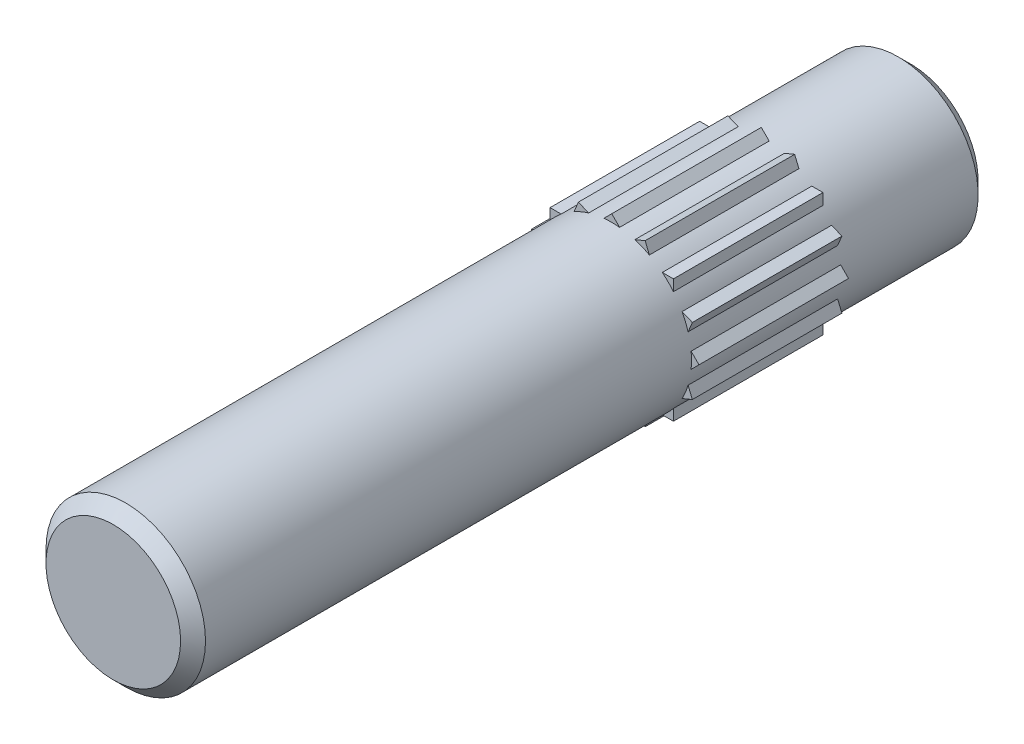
ISO-10303-21;
HEADER;
FILE_DESCRIPTION(('STEP AP214'),'2;1');
FILE_NAME('part.step','',(''),(''),'','','');
FILE_SCHEMA(('AUTOMOTIVE_DESIGN { 1 0 10303 214 1 1 1 1 }'));
ENDSEC;
DATA;
#1=APPLICATION_CONTEXT('core data for automotive mechanical design processes');
#2=APPLICATION_PROTOCOL_DEFINITION('international standard','automotive_design',2000,#1);
#3=PRODUCT_CONTEXT('',#1,'mechanical');
#4=PRODUCT('Part','Part','',(#3));
#5=PRODUCT_RELATED_PRODUCT_CATEGORY('part','',(#4));
#6=PRODUCT_DEFINITION_FORMATION('','',#4);
#7=PRODUCT_DEFINITION_CONTEXT('part definition',#1,'design');
#8=PRODUCT_DEFINITION('design','',#6,#7);
#9=PRODUCT_DEFINITION_SHAPE('','',#8);
#10=(LENGTH_UNIT() NAMED_UNIT(*) SI_UNIT(.MILLI.,.METRE.));
#11=(NAMED_UNIT(*) PLANE_ANGLE_UNIT() SI_UNIT($,.RADIAN.));
#12=(NAMED_UNIT(*) SI_UNIT($,.STERADIAN.) SOLID_ANGLE_UNIT());
#13=UNCERTAINTY_MEASURE_WITH_UNIT(LENGTH_MEASURE(1.E-05),#10,'distance_accuracy_value','');
#14=(GEOMETRIC_REPRESENTATION_CONTEXT(3) GLOBAL_UNCERTAINTY_ASSIGNED_CONTEXT((#13)) GLOBAL_UNIT_ASSIGNED_CONTEXT((#10,
#11,#12)) REPRESENTATION_CONTEXT('',''));
#15=CARTESIAN_POINT('',(0.,0.,0.));
#16=DIRECTION('',(0.,0.,1.));
#17=DIRECTION('',(1.,0.,0.));
#18=AXIS2_PLACEMENT_3D('',#15,#16,#17);
#19=CARTESIAN_POINT('',(0.,0.,0.));
#20=DIRECTION('',(0.,0.,-1.));
#21=DIRECTION('',(-1.,0.,0.));
#22=AXIS2_PLACEMENT_3D('',#19,#20,#21);
#23=PLANE('',#22);
#24=DIRECTION('',(0.382683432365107,0.923879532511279,0.));
#25=VECTOR('',#24,1.);
#26=CARTESIAN_POINT('',(-1.61678918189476,-0.669696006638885,0.));
#27=LINE('',#26,#25);
#28=CARTESIAN_POINT('',(-1.61678918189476,-0.669696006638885,0.));
#29=VERTEX_POINT('',#28);
#30=CARTESIAN_POINT('',(-1.53138812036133,-0.46351960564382,0.));
#31=VERTEX_POINT('',#30);
#32=EDGE_CURVE('E652',#29,#31,#27,.T.);
#33=ORIENTED_EDGE('',*,*,#32,.T.);
#34=CARTESIAN_POINT('',(0.,0.,0.));
#35=DIRECTION('',(0.,0.,-1.));
#36=DIRECTION('',(-1.,0.,0.));
#37=AXIS2_PLACEMENT_3D('',#34,#35,#36);
#38=CIRCLE('',#37,1.6);
#39=CARTESIAN_POINT('',(-1.4106127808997,-0.755097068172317,0.));
#40=VERTEX_POINT('',#39);
#41=EDGE_CURVE('E345',#40,#31,#38,.T.);
#42=ORIENTED_EDGE('',*,*,#41,.F.);
#43=DIRECTION('',(-0.923879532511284,0.382683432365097,0.));
#44=VECTOR('',#43,1.);
#45=CARTESIAN_POINT('',(-1.61678918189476,-0.669696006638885,0.));
#46=LINE('',#45,#44);
#47=EDGE_CURVE('E633',#40,#29,#46,.T.);
#48=ORIENTED_EDGE('',*,*,#47,.T.);
#49=EDGE_LOOP('',(#33,#42,#48));
#50=FACE_BOUND('',#49,.T.);
#51=ADVANCED_FACE('F33',(#50),#23,.T.);
#52=DIRECTION('',(0.,1.,0.));
#53=VECTOR('',#52,1.);
#54=CARTESIAN_POINT('',(-1.23743686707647,-1.23743686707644,0.));
#55=LINE('',#54,#53);
#56=CARTESIAN_POINT('',(-1.23743686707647,-1.23743686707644,0.));
#57=VERTEX_POINT('',#56);
#58=CARTESIAN_POINT('',(-1.23743686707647,-1.01427313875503,0.));
#59=VERTEX_POINT('',#58);
#60=EDGE_CURVE('E672',#57,#59,#55,.T.);
#61=ORIENTED_EDGE('',*,*,#60,.T.);
#62=CARTESIAN_POINT('',(-1.01427313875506,-1.23743686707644,0.));
#63=VERTEX_POINT('',#62);
#64=EDGE_CURVE('E965',#63,#59,#38,.T.);
#65=ORIENTED_EDGE('',*,*,#64,.F.);
#66=DIRECTION('',(-1.,0.,0.));
#67=VECTOR('',#66,1.);
#68=CARTESIAN_POINT('',(-1.23743686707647,-1.23743686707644,0.));
#69=LINE('',#68,#67);
#70=EDGE_CURVE('E657',#63,#57,#69,.T.);
#71=ORIENTED_EDGE('',*,*,#70,.T.);
#72=EDGE_LOOP('',(#61,#65,#71));
#73=FACE_BOUND('',#72,.T.);
#74=ADVANCED_FACE('F380',(#73),#23,.T.);
#75=DIRECTION('',(-0.382683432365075,0.923879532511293,0.));
#76=VECTOR('',#75,1.);
#77=CARTESIAN_POINT('',(-0.669696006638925,-1.61678918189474,0.));
#78=LINE('',#77,#76);
#79=CARTESIAN_POINT('',(-0.669696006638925,-1.61678918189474,0.));
#80=VERTEX_POINT('',#79);
#81=CARTESIAN_POINT('',(-0.755097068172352,-1.41061278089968,0.));
#82=VERTEX_POINT('',#81);
#83=EDGE_CURVE('E693',#80,#82,#78,.T.);
#84=ORIENTED_EDGE('',*,*,#83,.T.);
#85=CARTESIAN_POINT('',(-0.463519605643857,-1.53138812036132,0.));
#86=VERTEX_POINT('',#85);
#87=EDGE_CURVE('E963',#86,#82,#38,.T.);
#88=ORIENTED_EDGE('',*,*,#87,.F.);
#89=DIRECTION('',(-0.923879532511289,-0.382683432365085,0.));
#90=VECTOR('',#89,1.);
#91=CARTESIAN_POINT('',(-0.669696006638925,-1.61678918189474,0.));
#92=LINE('',#91,#90);
#93=EDGE_CURVE('E678',#86,#80,#92,.T.);
#94=ORIENTED_EDGE('',*,*,#93,.T.);
#95=EDGE_LOOP('',(#84,#88,#94));
#96=FACE_BOUND('',#95,.T.);
#97=ADVANCED_FACE('F386',(#96),#23,.T.);
#98=DIRECTION('',(-0.707106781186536,0.707106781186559,0.));
#99=VECTOR('',#98,1.);
#100=CARTESIAN_POINT('',(0.,-1.75,0.));
#101=LINE('',#100,#99);
#102=CARTESIAN_POINT('',(0.,-1.75,0.));
#103=VERTEX_POINT('',#102);
#104=CARTESIAN_POINT('',(-0.157800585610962,-1.59219941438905,0.));
#105=VERTEX_POINT('',#104);
#106=EDGE_CURVE('E714',#103,#105,#101,.T.);
#107=ORIENTED_EDGE('',*,*,#106,.T.);
#108=CARTESIAN_POINT('',(0.157800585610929,-1.59219941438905,0.));
#109=VERTEX_POINT('',#108);
#110=EDGE_CURVE('E961',#109,#105,#38,.T.);
#111=ORIENTED_EDGE('',*,*,#110,.F.);
#112=DIRECTION('',(-0.707106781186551,-0.707106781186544,0.));
#113=VECTOR('',#112,1.);
#114=CARTESIAN_POINT('',(0.,-1.75,0.));
#115=LINE('',#114,#113);
#116=EDGE_CURVE('E699',#109,#103,#115,.T.);
#117=ORIENTED_EDGE('',*,*,#116,.T.);
#118=EDGE_LOOP('',(#107,#111,#117));
#119=FACE_BOUND('',#118,.T.);
#120=ADVANCED_FACE('F984',(#119),#23,.T.);
#121=DIRECTION('',(-0.923879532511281,0.382683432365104,0.));
#122=VECTOR('',#121,1.);
#123=CARTESIAN_POINT('',(0.669696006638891,-1.61678918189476,0.));
#124=LINE('',#123,#122);
#125=CARTESIAN_POINT('',(0.669696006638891,-1.61678918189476,0.));
#126=VERTEX_POINT('',#125);
#127=CARTESIAN_POINT('',(0.463519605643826,-1.53138812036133,0.));
#128=VERTEX_POINT('',#127);
#129=EDGE_CURVE('E735',#126,#128,#124,.T.);
#130=ORIENTED_EDGE('',*,*,#129,.T.);
#131=CARTESIAN_POINT('',(0.755097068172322,-1.41061278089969,0.));
#132=VERTEX_POINT('',#131);
#133=EDGE_CURVE('E959',#132,#128,#38,.T.);
#134=ORIENTED_EDGE('',*,*,#133,.F.);
#135=DIRECTION('',(-0.382683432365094,-0.923879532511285,0.));
#136=VECTOR('',#135,1.);
#137=CARTESIAN_POINT('',(0.669696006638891,-1.61678918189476,0.));
#138=LINE('',#137,#136);
#139=EDGE_CURVE('E720',#132,#126,#138,.T.);
#140=ORIENTED_EDGE('',*,*,#139,.T.);
#141=EDGE_LOOP('',(#130,#134,#140));
#142=FACE_BOUND('',#141,.T.);
#143=ADVANCED_FACE('F988',(#142),#23,.T.);
#144=DIRECTION('',(-1.,0.,0.));
#145=VECTOR('',#144,1.);
#146=CARTESIAN_POINT('',(1.23743686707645,-1.23743686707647,0.));
#147=LINE('',#146,#145);
#148=CARTESIAN_POINT('',(1.23743686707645,-1.23743686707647,0.));
#149=VERTEX_POINT('',#148);
#150=CARTESIAN_POINT('',(1.01427313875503,-1.23743686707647,0.));
#151=VERTEX_POINT('',#150);
#152=EDGE_CURVE('E756',#149,#151,#147,.T.);
#153=ORIENTED_EDGE('',*,*,#152,.T.);
#154=CARTESIAN_POINT('',(1.23743686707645,-1.01427313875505,0.));
#155=VERTEX_POINT('',#154);
#156=EDGE_CURVE('E957',#155,#151,#38,.T.);
#157=ORIENTED_EDGE('',*,*,#156,.F.);
#158=DIRECTION('',(0.,-1.,0.));
#159=VECTOR('',#158,1.);
#160=CARTESIAN_POINT('',(1.23743686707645,-1.23743686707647,0.));
#161=LINE('',#160,#159);
#162=EDGE_CURVE('E741',#155,#149,#161,.T.);
#163=ORIENTED_EDGE('',*,*,#162,.T.);
#164=EDGE_LOOP('',(#153,#157,#163));
#165=FACE_BOUND('',#164,.T.);
#166=ADVANCED_FACE('F993',(#165),#23,.T.);
#167=DIRECTION('',(-0.923879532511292,-0.382683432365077,0.));
#168=VECTOR('',#167,1.);
#169=CARTESIAN_POINT('',(1.61678918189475,-0.66969600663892,0.));
#170=LINE('',#169,#168);
#171=CARTESIAN_POINT('',(1.61678918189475,-0.66969600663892,0.));
#172=VERTEX_POINT('',#171);
#173=CARTESIAN_POINT('',(1.41061278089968,-0.755097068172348,0.));
#174=VERTEX_POINT('',#173);
#175=EDGE_CURVE('E777',#172,#174,#170,.T.);
#176=ORIENTED_EDGE('',*,*,#175,.T.);
#177=CARTESIAN_POINT('',(1.53138812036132,-0.463519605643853,0.));
#178=VERTEX_POINT('',#177);
#179=EDGE_CURVE('E955',#178,#174,#38,.T.);
#180=ORIENTED_EDGE('',*,*,#179,.F.);
#181=DIRECTION('',(0.382683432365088,-0.923879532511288,0.));
#182=VECTOR('',#181,1.);
#183=CARTESIAN_POINT('',(1.61678918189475,-0.66969600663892,0.));
#184=LINE('',#183,#182);
#185=EDGE_CURVE('E762',#178,#172,#184,.T.);
#186=ORIENTED_EDGE('',*,*,#185,.T.);
#187=EDGE_LOOP('',(#176,#180,#186));
#188=FACE_BOUND('',#187,.T.);
#189=ADVANCED_FACE('F1005',(#188),#23,.T.);
#190=DIRECTION('',(-0.707106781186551,-0.707106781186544,0.));
#191=VECTOR('',#190,1.);
#192=CARTESIAN_POINT('',(1.75,0.,0.));
#193=LINE('',#192,#191);
#194=CARTESIAN_POINT('',(1.75,0.,0.));
#195=VERTEX_POINT('',#194);
#196=CARTESIAN_POINT('',(1.59219941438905,-0.157800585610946,0.));
#197=VERTEX_POINT('',#196);
#198=EDGE_CURVE('E798',#195,#197,#193,.T.);
#199=ORIENTED_EDGE('',*,*,#198,.T.);
#200=CARTESIAN_POINT('',(1.59219941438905,0.157800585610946,0.));
#201=VERTEX_POINT('',#200);
#202=EDGE_CURVE('E953',#201,#197,#38,.T.);
#203=ORIENTED_EDGE('',*,*,#202,.F.);
#204=DIRECTION('',(0.707106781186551,-0.707106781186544,0.));
#205=VECTOR('',#204,1.);
#206=CARTESIAN_POINT('',(1.75,0.,0.));
#207=LINE('',#206,#205);
#208=EDGE_CURVE('E783',#201,#195,#207,.T.);
#209=ORIENTED_EDGE('',*,*,#208,.T.);
#210=EDGE_LOOP('',(#199,#203,#209));
#211=FACE_BOUND('',#210,.T.);
#212=ADVANCED_FACE('F1017',(#211),#23,.T.);
#213=DIRECTION('',(-0.3826834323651,-0.923879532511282,0.));
#214=VECTOR('',#213,1.);
#215=CARTESIAN_POINT('',(1.61678918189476,0.669696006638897,0.));
#216=LINE('',#215,#214);
#217=CARTESIAN_POINT('',(1.61678918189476,0.669696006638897,0.));
#218=VERTEX_POINT('',#217);
#219=CARTESIAN_POINT('',(1.53138812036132,0.463519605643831,0.));
#220=VERTEX_POINT('',#219);
#221=EDGE_CURVE('E819',#218,#220,#216,.T.);
#222=ORIENTED_EDGE('',*,*,#221,.T.);
#223=CARTESIAN_POINT('',(1.41061278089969,0.755097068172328,0.));
#224=VERTEX_POINT('',#223);
#225=EDGE_CURVE('E951',#224,#220,#38,.T.);
#226=ORIENTED_EDGE('',*,*,#225,.F.);
#227=DIRECTION('',(0.923879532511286,-0.38268343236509,0.));
#228=VECTOR('',#227,1.);
#229=CARTESIAN_POINT('',(1.61678918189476,0.669696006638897,0.));
#230=LINE('',#229,#228);
#231=EDGE_CURVE('E804',#224,#218,#230,.T.);
#232=ORIENTED_EDGE('',*,*,#231,.T.);
#233=EDGE_LOOP('',(#222,#226,#232));
#234=FACE_BOUND('',#233,.T.);
#235=ADVANCED_FACE('F1029',(#234),#23,.T.);
#236=DIRECTION('',(0.,-1.,0.));
#237=VECTOR('',#236,1.);
#238=CARTESIAN_POINT('',(1.23743686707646,1.23743686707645,0.));
#239=LINE('',#238,#237);
#240=CARTESIAN_POINT('',(1.23743686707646,1.23743686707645,0.));
#241=VERTEX_POINT('',#240);
#242=CARTESIAN_POINT('',(1.23743686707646,1.01427313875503,0.));
#243=VERTEX_POINT('',#242);
#244=EDGE_CURVE('E840',#241,#243,#239,.T.);
#245=ORIENTED_EDGE('',*,*,#244,.T.);
#246=CARTESIAN_POINT('',(1.01427313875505,1.23743686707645,0.));
#247=VERTEX_POINT('',#246);
#248=EDGE_CURVE('E949',#247,#243,#38,.T.);
#249=ORIENTED_EDGE('',*,*,#248,.F.);
#250=DIRECTION('',(1.,0.,0.));
#251=VECTOR('',#250,1.);
#252=CARTESIAN_POINT('',(1.23743686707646,1.23743686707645,0.));
#253=LINE('',#252,#251);
#254=EDGE_CURVE('E825',#247,#241,#253,.T.);
#255=ORIENTED_EDGE('',*,*,#254,.T.);
#256=EDGE_LOOP('',(#245,#249,#255));
#257=FACE_BOUND('',#256,.T.);
#258=ADVANCED_FACE('F1041',(#257),#23,.T.);
#259=DIRECTION('',(0.382683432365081,-0.923879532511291,0.));
#260=VECTOR('',#259,1.);
#261=CARTESIAN_POINT('',(0.669696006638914,1.61678918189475,0.));
#262=LINE('',#261,#260);
#263=CARTESIAN_POINT('',(0.669696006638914,1.61678918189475,0.));
#264=VERTEX_POINT('',#263);
#265=CARTESIAN_POINT('',(0.755097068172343,1.41061278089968,0.));
#266=VERTEX_POINT('',#265);
#267=EDGE_CURVE('E861',#264,#266,#262,.T.);
#268=ORIENTED_EDGE('',*,*,#267,.T.);
#269=CARTESIAN_POINT('',(0.463519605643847,1.53138812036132,0.));
#270=VERTEX_POINT('',#269);
#271=EDGE_CURVE('E947',#270,#266,#38,.T.);
#272=ORIENTED_EDGE('',*,*,#271,.F.);
#273=DIRECTION('',(0.923879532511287,0.382683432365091,0.));
#274=VECTOR('',#273,1.);
#275=CARTESIAN_POINT('',(0.669696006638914,1.61678918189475,0.));
#276=LINE('',#275,#274);
#277=EDGE_CURVE('E846',#270,#264,#276,.T.);
#278=ORIENTED_EDGE('',*,*,#277,.T.);
#279=EDGE_LOOP('',(#268,#272,#278));
#280=FACE_BOUND('',#279,.T.);
#281=ADVANCED_FACE('F1053',(#280),#23,.T.);
#282=DIRECTION('',(0.707106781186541,-0.707106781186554,0.));
#283=VECTOR('',#282,1.);
#284=CARTESIAN_POINT('',(0.,1.75,0.));
#285=LINE('',#284,#283);
#286=CARTESIAN_POINT('',(0.,1.75,0.));
#287=VERTEX_POINT('',#286);
#288=CARTESIAN_POINT('',(0.157800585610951,1.59219941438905,0.));
#289=VERTEX_POINT('',#288);
#290=EDGE_CURVE('E882',#287,#289,#285,.T.);
#291=ORIENTED_EDGE('',*,*,#290,.T.);
#292=CARTESIAN_POINT('',(-0.15780058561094,1.59219941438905,0.));
#293=VERTEX_POINT('',#292);
#294=EDGE_CURVE('E945',#293,#289,#38,.T.);
#295=ORIENTED_EDGE('',*,*,#294,.F.);
#296=DIRECTION('',(0.707106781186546,0.707106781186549,0.));
#297=VECTOR('',#296,1.);
#298=CARTESIAN_POINT('',(0.,1.75,0.));
#299=LINE('',#298,#297);
#300=EDGE_CURVE('E867',#293,#287,#299,.T.);
#301=ORIENTED_EDGE('',*,*,#300,.T.);
#302=EDGE_LOOP('',(#291,#295,#301));
#303=FACE_BOUND('',#302,.T.);
#304=ADVANCED_FACE('F1065',(#303),#23,.T.);
#305=DIRECTION('',(0.923879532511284,-0.382683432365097,0.));
#306=VECTOR('',#305,1.);
#307=CARTESIAN_POINT('',(-0.669696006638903,1.61678918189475,0.));
#308=LINE('',#307,#306);
#309=CARTESIAN_POINT('',(-0.669696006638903,1.61678918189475,0.));
#310=VERTEX_POINT('',#309);
#311=CARTESIAN_POINT('',(-0.463519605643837,1.53138812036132,0.));
#312=VERTEX_POINT('',#311);
#313=EDGE_CURVE('E903',#310,#312,#308,.T.);
#314=ORIENTED_EDGE('',*,*,#313,.T.);
#315=CARTESIAN_POINT('',(-0.755097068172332,1.41061278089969,0.));
#316=VERTEX_POINT('',#315);
#317=EDGE_CURVE('E943',#316,#312,#38,.T.);
#318=ORIENTED_EDGE('',*,*,#317,.F.);
#319=DIRECTION('',(0.382683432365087,0.923879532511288,0.));
#320=VECTOR('',#319,1.);
#321=CARTESIAN_POINT('',(-0.669696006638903,1.61678918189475,0.));
#322=LINE('',#321,#320);
#323=EDGE_CURVE('E888',#316,#310,#322,.T.);
#324=ORIENTED_EDGE('',*,*,#323,.T.);
#325=EDGE_LOOP('',(#314,#318,#324));
#326=FACE_BOUND('',#325,.T.);
#327=ADVANCED_FACE('F411',(#326),#23,.T.);
#328=DIRECTION('',(1.,0.,0.));
#329=VECTOR('',#328,1.);
#330=CARTESIAN_POINT('',(-1.23743686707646,1.23743686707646,0.));
#331=LINE('',#330,#329);
#332=CARTESIAN_POINT('',(-1.23743686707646,1.23743686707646,0.));
#333=VERTEX_POINT('',#332);
#334=CARTESIAN_POINT('',(-1.01427313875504,1.23743686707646,0.));
#335=VERTEX_POINT('',#334);
#336=EDGE_CURVE('E924',#333,#335,#331,.T.);
#337=ORIENTED_EDGE('',*,*,#336,.T.);
#338=CARTESIAN_POINT('',(-1.23743686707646,1.01427313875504,0.));
#339=VERTEX_POINT('',#338);
#340=EDGE_CURVE('E643',#339,#335,#38,.T.);
#341=ORIENTED_EDGE('',*,*,#340,.F.);
#342=DIRECTION('',(0.,1.,0.));
#343=VECTOR('',#342,1.);
#344=CARTESIAN_POINT('',(-1.23743686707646,1.23743686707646,0.));
#345=LINE('',#344,#343);
#346=EDGE_CURVE('E909',#339,#333,#345,.T.);
#347=ORIENTED_EDGE('',*,*,#346,.T.);
#348=EDGE_LOOP('',(#337,#341,#347));
#349=FACE_BOUND('',#348,.T.);
#350=ADVANCED_FACE('F404',(#349),#23,.T.);
#351=DIRECTION('',(0.923879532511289,0.382683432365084,0.));
#352=VECTOR('',#351,1.);
#353=CARTESIAN_POINT('',(-1.61678918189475,0.669696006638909,0.));
#354=LINE('',#353,#352);
#355=CARTESIAN_POINT('',(-1.61678918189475,0.669696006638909,0.));
#356=VERTEX_POINT('',#355);
#357=CARTESIAN_POINT('',(-1.41061278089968,0.755097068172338,0.));
#358=VERTEX_POINT('',#357);
#359=EDGE_CURVE('E415',#356,#358,#354,.T.);
#360=ORIENTED_EDGE('',*,*,#359,.T.);
#361=CARTESIAN_POINT('',(-1.53138812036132,0.463519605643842,0.));
#362=VERTEX_POINT('',#361);
#363=EDGE_CURVE('E347',#362,#358,#38,.T.);
#364=ORIENTED_EDGE('',*,*,#363,.F.);
#365=DIRECTION('',(-0.382683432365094,0.923879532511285,0.));
#366=VECTOR('',#365,1.);
#367=CARTESIAN_POINT('',(-1.61678918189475,0.669696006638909,0.));
#368=LINE('',#367,#366);
#369=EDGE_CURVE('E418',#362,#356,#368,.T.);
#370=ORIENTED_EDGE('',*,*,#369,.T.);
#371=EDGE_LOOP('',(#360,#364,#370));
#372=FACE_BOUND('',#371,.T.);
#373=ADVANCED_FACE('F393',(#372),#23,.T.);
#374=CARTESIAN_POINT('',(-1.75,0.,3.));
#375=DIRECTION('',(-0.707106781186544,-0.707106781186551,0.));
#376=DIRECTION('',(0.707106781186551,-0.707106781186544,0.));
#377=AXIS2_PLACEMENT_3D('',#374,#375,#376);
#378=PLANE('',#377);
#379=DIRECTION('',(-0.707106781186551,0.707106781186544,0.));
#380=VECTOR('',#379,1.);
#381=CARTESIAN_POINT('',(-1.75,0.,0.));
#382=LINE('',#381,#380);
#383=CARTESIAN_POINT('',(-1.59219941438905,-0.157800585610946,0.));
#384=VERTEX_POINT('',#383);
#385=CARTESIAN_POINT('',(-1.75,0.,0.));
#386=VERTEX_POINT('',#385);
#387=EDGE_CURVE('E354',#384,#386,#382,.T.);
#388=ORIENTED_EDGE('',*,*,#387,.F.);
#389=DIRECTION('',(0.,0.,-1.));
#390=VECTOR('',#389,1.);
#391=CARTESIAN_POINT('',(-1.59219941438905,-0.157800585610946,3.));
#392=LINE('',#391,#390);
#393=CARTESIAN_POINT('',(-1.59219941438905,-0.157800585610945,3.));
#394=VERTEX_POINT('',#393);
#395=EDGE_CURVE('E340',#394,#384,#392,.T.);
#396=ORIENTED_EDGE('',*,*,#395,.F.);
#397=DIRECTION('',(-0.707106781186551,0.707106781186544,0.));
#398=VECTOR('',#397,1.);
#399=CARTESIAN_POINT('',(-1.75,0.,3.));
#400=LINE('',#399,#398);
#401=CARTESIAN_POINT('',(-1.75,0.,3.));
#402=VERTEX_POINT('',#401);
#403=EDGE_CURVE('E355',#394,#402,#400,.T.);
#404=ORIENTED_EDGE('',*,*,#403,.T.);
#405=DIRECTION('',(0.,0.,-1.));
#406=VECTOR('',#405,1.);
#407=CARTESIAN_POINT('',(-1.75,0.,3.));
#408=LINE('',#407,#406);
#409=EDGE_CURVE('E48',#402,#386,#408,.T.);
#410=ORIENTED_EDGE('',*,*,#409,.T.);
#411=EDGE_LOOP('',(#388,#396,#404,#410));
#412=FACE_BOUND('',#411,.T.);
#413=ADVANCED_FACE('F403',(#412),#378,.T.);
#414=CARTESIAN_POINT('',(-1.75,0.,3.));
#415=DIRECTION('',(-0.707106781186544,0.707106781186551,0.));
#416=DIRECTION('',(-0.707106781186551,-0.707106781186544,0.));
#417=AXIS2_PLACEMENT_3D('',#414,#415,#416);
#418=PLANE('',#417);
#419=DIRECTION('',(0.707106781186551,0.707106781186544,0.));
#420=VECTOR('',#419,1.);
#421=CARTESIAN_POINT('',(-1.75,0.,0.));
#422=LINE('',#421,#420);
#423=CARTESIAN_POINT('',(-1.59219941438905,0.157800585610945,0.));
#424=VERTEX_POINT('',#423);
#425=EDGE_CURVE('E349',#386,#424,#422,.T.);
#426=ORIENTED_EDGE('',*,*,#425,.F.);
#427=ORIENTED_EDGE('',*,*,#409,.F.);
#428=DIRECTION('',(0.707106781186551,0.707106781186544,0.));
#429=VECTOR('',#428,1.);
#430=CARTESIAN_POINT('',(-1.75,0.,3.));
#431=LINE('',#430,#429);
#432=CARTESIAN_POINT('',(-1.59219941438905,0.157800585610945,3.));
#433=VERTEX_POINT('',#432);
#434=EDGE_CURVE('E350',#402,#433,#431,.T.);
#435=ORIENTED_EDGE('',*,*,#434,.T.);
#436=DIRECTION('',(0.,0.,-1.));
#437=VECTOR('',#436,1.);
#438=CARTESIAN_POINT('',(-1.59219941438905,0.157800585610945,3.));
#439=LINE('',#438,#437);
#440=EDGE_CURVE('E338',#433,#424,#439,.T.);
#441=ORIENTED_EDGE('',*,*,#440,.T.);
#442=EDGE_LOOP('',(#426,#427,#435,#441));
#443=FACE_BOUND('',#442,.T.);
#444=ADVANCED_FACE('F348',(#443),#418,.T.);
#445=CARTESIAN_POINT('',(0.,0.,3.));
#446=DIRECTION('',(0.,0.,-1.));
#447=DIRECTION('',(-1.,0.,0.));
#448=AXIS2_PLACEMENT_3D('',#445,#446,#447);
#449=PLANE('',#448);
#450=ORIENTED_EDGE('',*,*,#403,.F.);
#451=CARTESIAN_POINT('',(0.,0.,3.));
#452=DIRECTION('',(0.,0.,1.));
#453=DIRECTION('',(-1.,0.,0.));
#454=AXIS2_PLACEMENT_3D('',#451,#452,#453);
#455=CIRCLE('',#454,1.6);
#456=EDGE_CURVE('E364',#433,#394,#455,.T.);
#457=ORIENTED_EDGE('',*,*,#456,.F.);
#458=ORIENTED_EDGE('',*,*,#434,.F.);
#459=EDGE_LOOP('',(#450,#457,#458));
#460=FACE_BOUND('',#459,.T.);
#461=ADVANCED_FACE('F392',(#460),#449,.F.);
#462=ORIENTED_EDGE('',*,*,#425,.T.);
#463=EDGE_CURVE('E334',#384,#424,#38,.T.);
#464=ORIENTED_EDGE('',*,*,#463,.F.);
#465=ORIENTED_EDGE('',*,*,#387,.T.);
#466=EDGE_LOOP('',(#462,#464,#465));
#467=FACE_BOUND('',#466,.T.);
#468=ADVANCED_FACE('F353',(#467),#23,.T.);
#469=CARTESIAN_POINT('',(0.,0.,13.));
#470=DIRECTION('',(0.,0.,-1.));
#471=DIRECTION('',(-1.,0.,0.));
#472=AXIS2_PLACEMENT_3D('',#469,#470,#471);
#473=CYLINDRICAL_SURFACE('',#472,1.6);
#474=CARTESIAN_POINT('',(0.,0.,-2.75));
#475=DIRECTION('',(0.,0.,-1.));
#476=DIRECTION('',(-1.,0.,0.));
#477=AXIS2_PLACEMENT_3D('',#474,#475,#476);
#478=CIRCLE('',#477,1.6);
#479=CARTESIAN_POINT('',(-1.6,0.,-2.75));
#480=VERTEX_POINT('',#479);
#481=EDGE_CURVE('E11',#480,#480,#478,.F.);
#482=ORIENTED_EDGE('',*,*,#481,.T.);
#483=EDGE_LOOP('',(#482));
#484=FACE_BOUND('',#483,.T.);
#485=ORIENTED_EDGE('',*,*,#463,.T.);
#486=ORIENTED_EDGE('',*,*,#440,.F.);
#487=ORIENTED_EDGE('',*,*,#456,.T.);
#488=ORIENTED_EDGE('',*,*,#395,.T.);
#489=EDGE_LOOP('',(#485,#486,#487,#488));
#490=FACE_BOUND('',#489,.T.);
#491=ORIENTED_EDGE('',*,*,#363,.T.);
#492=DIRECTION('',(0.,0.,-1.));
#493=VECTOR('',#492,1.);
#494=CARTESIAN_POINT('',(-1.41061278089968,0.755097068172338,3.));
#495=LINE('',#494,#493);
#496=CARTESIAN_POINT('',(-1.41061278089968,0.755097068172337,3.));
#497=VERTEX_POINT('',#496);
#498=EDGE_CURVE('E429',#497,#358,#495,.T.);
#499=ORIENTED_EDGE('',*,*,#498,.F.);
#500=CARTESIAN_POINT('',(0.,0.,3.));
#501=DIRECTION('',(0.,0.,1.));
#502=DIRECTION('',(-0.923879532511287,0.382683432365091,0.));
#503=AXIS2_PLACEMENT_3D('',#500,#501,#502);
#504=CIRCLE('',#503,1.6);
#505=CARTESIAN_POINT('',(-1.53138812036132,0.463519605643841,3.));
#506=VERTEX_POINT('',#505);
#507=EDGE_CURVE('E424',#497,#506,#504,.T.);
#508=ORIENTED_EDGE('',*,*,#507,.T.);
#509=DIRECTION('',(0.,0.,-1.));
#510=VECTOR('',#509,1.);
#511=CARTESIAN_POINT('',(-1.53138812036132,0.463519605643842,3.));
#512=LINE('',#511,#510);
#513=EDGE_CURVE('E931',#506,#362,#512,.T.);
#514=ORIENTED_EDGE('',*,*,#513,.T.);
#515=EDGE_LOOP('',(#491,#499,#508,#514));
#516=FACE_BOUND('',#515,.T.);
#517=ORIENTED_EDGE('',*,*,#340,.T.);
#518=DIRECTION('',(0.,0.,-1.));
#519=VECTOR('',#518,1.);
#520=CARTESIAN_POINT('',(-1.01427313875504,1.23743686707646,3.));
#521=LINE('',#520,#519);
#522=CARTESIAN_POINT('',(-1.01427313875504,1.23743686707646,3.));
#523=VERTEX_POINT('',#522);
#524=EDGE_CURVE('E919',#523,#335,#521,.T.);
#525=ORIENTED_EDGE('',*,*,#524,.F.);
#526=CARTESIAN_POINT('',(0.,0.,3.));
#527=DIRECTION('',(0.,0.,1.));
#528=DIRECTION('',(-0.707106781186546,0.707106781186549,0.));
#529=AXIS2_PLACEMENT_3D('',#526,#527,#528);
#530=CIRCLE('',#529,1.6);
#531=CARTESIAN_POINT('',(-1.23743686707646,1.01427313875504,3.));
#532=VERTEX_POINT('',#531);
#533=EDGE_CURVE('E922',#523,#532,#530,.T.);
#534=ORIENTED_EDGE('',*,*,#533,.T.);
#535=DIRECTION('',(0.,0.,-1.));
#536=VECTOR('',#535,1.);
#537=CARTESIAN_POINT('',(-1.23743686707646,1.01427313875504,3.));
#538=LINE('',#537,#536);
#539=EDGE_CURVE('E911',#532,#339,#538,.T.);
#540=ORIENTED_EDGE('',*,*,#539,.T.);
#541=EDGE_LOOP('',(#517,#525,#534,#540));
#542=FACE_BOUND('',#541,.T.);
#543=ORIENTED_EDGE('',*,*,#317,.T.);
#544=DIRECTION('',(0.,0.,-1.));
#545=VECTOR('',#544,1.);
#546=CARTESIAN_POINT('',(-0.463519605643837,1.53138812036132,3.));
#547=LINE('',#546,#545);
#548=CARTESIAN_POINT('',(-0.463519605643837,1.53138812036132,3.));
#549=VERTEX_POINT('',#548);
#550=EDGE_CURVE('E898',#549,#312,#547,.T.);
#551=ORIENTED_EDGE('',*,*,#550,.F.);
#552=CARTESIAN_POINT('',(0.,0.,3.));
#553=DIRECTION('',(0.,0.,1.));
#554=DIRECTION('',(-0.382683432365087,0.923879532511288,0.));
#555=AXIS2_PLACEMENT_3D('',#552,#553,#554);
#556=CIRCLE('',#555,1.6);
#557=CARTESIAN_POINT('',(-0.755097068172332,1.41061278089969,3.));
#558=VERTEX_POINT('',#557);
#559=EDGE_CURVE('E901',#549,#558,#556,.T.);
#560=ORIENTED_EDGE('',*,*,#559,.T.);
#561=DIRECTION('',(0.,0.,-1.));
#562=VECTOR('',#561,1.);
#563=CARTESIAN_POINT('',(-0.755097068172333,1.41061278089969,3.));
#564=LINE('',#563,#562);
#565=EDGE_CURVE('E890',#558,#316,#564,.T.);
#566=ORIENTED_EDGE('',*,*,#565,.T.);
#567=EDGE_LOOP('',(#543,#551,#560,#566));
#568=FACE_BOUND('',#567,.T.);
#569=ORIENTED_EDGE('',*,*,#294,.T.);
#570=DIRECTION('',(0.,0.,-1.));
#571=VECTOR('',#570,1.);
#572=CARTESIAN_POINT('',(0.157800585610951,1.59219941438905,3.));
#573=LINE('',#572,#571);
#574=CARTESIAN_POINT('',(0.157800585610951,1.59219941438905,3.));
#575=VERTEX_POINT('',#574);
#576=EDGE_CURVE('E877',#575,#289,#573,.T.);
#577=ORIENTED_EDGE('',*,*,#576,.F.);
#578=CARTESIAN_POINT('',(0.,0.,3.));
#579=DIRECTION('',(0.,0.,1.));
#580=DIRECTION('',(0.,1.,0.));
#581=AXIS2_PLACEMENT_3D('',#578,#579,#580);
#582=CIRCLE('',#581,1.6);
#583=CARTESIAN_POINT('',(-0.15780058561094,1.59219941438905,3.));
#584=VERTEX_POINT('',#583);
#585=EDGE_CURVE('E880',#575,#584,#582,.T.);
#586=ORIENTED_EDGE('',*,*,#585,.T.);
#587=DIRECTION('',(0.,0.,-1.));
#588=VECTOR('',#587,1.);
#589=CARTESIAN_POINT('',(-0.157800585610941,1.59219941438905,3.));
#590=LINE('',#589,#588);
#591=EDGE_CURVE('E869',#584,#293,#590,.T.);
#592=ORIENTED_EDGE('',*,*,#591,.T.);
#593=EDGE_LOOP('',(#569,#577,#586,#592));
#594=FACE_BOUND('',#593,.T.);
#595=ORIENTED_EDGE('',*,*,#271,.T.);
#596=DIRECTION('',(0.,0.,-1.));
#597=VECTOR('',#596,1.);
#598=CARTESIAN_POINT('',(0.755097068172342,1.41061278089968,3.));
#599=LINE('',#598,#597);
#600=CARTESIAN_POINT('',(0.755097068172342,1.41061278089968,3.));
#601=VERTEX_POINT('',#600);
#602=EDGE_CURVE('E856',#601,#266,#599,.T.);
#603=ORIENTED_EDGE('',*,*,#602,.F.);
#604=CARTESIAN_POINT('',(0.,0.,3.));
#605=DIRECTION('',(0.,0.,1.));
#606=DIRECTION('',(0.382683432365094,0.923879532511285,0.));
#607=AXIS2_PLACEMENT_3D('',#604,#605,#606);
#608=CIRCLE('',#607,1.6);
#609=CARTESIAN_POINT('',(0.463519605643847,1.53138812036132,3.));
#610=VERTEX_POINT('',#609);
#611=EDGE_CURVE('E859',#601,#610,#608,.T.);
#612=ORIENTED_EDGE('',*,*,#611,.T.);
#613=DIRECTION('',(0.,0.,-1.));
#614=VECTOR('',#613,1.);
#615=CARTESIAN_POINT('',(0.463519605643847,1.53138812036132,3.));
#616=LINE('',#615,#614);
#617=EDGE_CURVE('E848',#610,#270,#616,.T.);
#618=ORIENTED_EDGE('',*,*,#617,.T.);
#619=EDGE_LOOP('',(#595,#603,#612,#618));
#620=FACE_BOUND('',#619,.T.);
#621=ORIENTED_EDGE('',*,*,#248,.T.);
#622=DIRECTION('',(0.,0.,-1.));
#623=VECTOR('',#622,1.);
#624=CARTESIAN_POINT('',(1.23743686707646,1.01427313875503,3.));
#625=LINE('',#624,#623);
#626=CARTESIAN_POINT('',(1.23743686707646,1.01427313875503,3.));
#627=VERTEX_POINT('',#626);
#628=EDGE_CURVE('E835',#627,#243,#625,.T.);
#629=ORIENTED_EDGE('',*,*,#628,.F.);
#630=CARTESIAN_POINT('',(0.,0.,3.));
#631=DIRECTION('',(0.,0.,1.));
#632=DIRECTION('',(0.707106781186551,0.707106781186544,0.));
#633=AXIS2_PLACEMENT_3D('',#630,#631,#632);
#634=CIRCLE('',#633,1.6);
#635=CARTESIAN_POINT('',(1.01427313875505,1.23743686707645,3.));
#636=VERTEX_POINT('',#635);
#637=EDGE_CURVE('E838',#627,#636,#634,.T.);
#638=ORIENTED_EDGE('',*,*,#637,.T.);
#639=DIRECTION('',(0.,0.,-1.));
#640=VECTOR('',#639,1.);
#641=CARTESIAN_POINT('',(1.01427313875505,1.23743686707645,3.));
#642=LINE('',#641,#640);
#643=EDGE_CURVE('E827',#636,#247,#642,.T.);
#644=ORIENTED_EDGE('',*,*,#643,.T.);
#645=EDGE_LOOP('',(#621,#629,#638,#644));
#646=FACE_BOUND('',#645,.T.);
#647=ORIENTED_EDGE('',*,*,#225,.T.);
#648=DIRECTION('',(0.,0.,-1.));
#649=VECTOR('',#648,1.);
#650=CARTESIAN_POINT('',(1.53138812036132,0.463519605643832,3.));
#651=LINE('',#650,#649);
#652=CARTESIAN_POINT('',(1.53138812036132,0.463519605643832,3.));
#653=VERTEX_POINT('',#652);
#654=EDGE_CURVE('E814',#653,#220,#651,.T.);
#655=ORIENTED_EDGE('',*,*,#654,.F.);
#656=CARTESIAN_POINT('',(0.,0.,3.));
#657=DIRECTION('',(0.,0.,1.));
#658=DIRECTION('',(0.923879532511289,0.382683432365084,0.));
#659=AXIS2_PLACEMENT_3D('',#656,#657,#658);
#660=CIRCLE('',#659,1.6);
#661=CARTESIAN_POINT('',(1.41061278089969,0.755097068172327,3.));
#662=VERTEX_POINT('',#661);
#663=EDGE_CURVE('E817',#653,#662,#660,.T.);
#664=ORIENTED_EDGE('',*,*,#663,.T.);
#665=DIRECTION('',(0.,0.,-1.));
#666=VECTOR('',#665,1.);
#667=CARTESIAN_POINT('',(1.41061278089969,0.755097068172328,3.));
#668=LINE('',#667,#666);
#669=EDGE_CURVE('E806',#662,#224,#668,.T.);
#670=ORIENTED_EDGE('',*,*,#669,.T.);
#671=EDGE_LOOP('',(#647,#655,#664,#670));
#672=FACE_BOUND('',#671,.T.);
#673=ORIENTED_EDGE('',*,*,#202,.T.);
#674=DIRECTION('',(0.,0.,-1.));
#675=VECTOR('',#674,1.);
#676=CARTESIAN_POINT('',(1.59219941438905,-0.157800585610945,3.));
#677=LINE('',#676,#675);
#678=CARTESIAN_POINT('',(1.59219941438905,-0.157800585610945,3.));
#679=VERTEX_POINT('',#678);
#680=EDGE_CURVE('E793',#679,#197,#677,.T.);
#681=ORIENTED_EDGE('',*,*,#680,.F.);
#682=CARTESIAN_POINT('',(0.,0.,3.));
#683=DIRECTION('',(0.,0.,1.));
#684=DIRECTION('',(1.,0.,0.));
#685=AXIS2_PLACEMENT_3D('',#682,#683,#684);
#686=CIRCLE('',#685,1.6);
#687=CARTESIAN_POINT('',(1.59219941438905,0.157800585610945,3.));
#688=VERTEX_POINT('',#687);
#689=EDGE_CURVE('E796',#679,#688,#686,.T.);
#690=ORIENTED_EDGE('',*,*,#689,.T.);
#691=DIRECTION('',(0.,0.,-1.));
#692=VECTOR('',#691,1.);
#693=CARTESIAN_POINT('',(1.59219941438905,0.157800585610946,3.));
#694=LINE('',#693,#692);
#695=EDGE_CURVE('E785',#688,#201,#694,.T.);
#696=ORIENTED_EDGE('',*,*,#695,.T.);
#697=EDGE_LOOP('',(#673,#681,#690,#696));
#698=FACE_BOUND('',#697,.T.);
#699=ORIENTED_EDGE('',*,*,#179,.T.);
#700=DIRECTION('',(0.,0.,-1.));
#701=VECTOR('',#700,1.);
#702=CARTESIAN_POINT('',(1.41061278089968,-0.755097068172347,3.));
#703=LINE('',#702,#701);
#704=CARTESIAN_POINT('',(1.41061278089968,-0.755097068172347,3.));
#705=VERTEX_POINT('',#704);
#706=EDGE_CURVE('E772',#705,#174,#703,.T.);
#707=ORIENTED_EDGE('',*,*,#706,.F.);
#708=CARTESIAN_POINT('',(0.,0.,3.));
#709=DIRECTION('',(0.,0.,1.));
#710=DIRECTION('',(0.923879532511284,-0.382683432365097,0.));
#711=AXIS2_PLACEMENT_3D('',#708,#709,#710);
#712=CIRCLE('',#711,1.6);
#713=CARTESIAN_POINT('',(1.53138812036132,-0.463519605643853,3.));
#714=VERTEX_POINT('',#713);
#715=EDGE_CURVE('E775',#705,#714,#712,.T.);
#716=ORIENTED_EDGE('',*,*,#715,.T.);
#717=DIRECTION('',(0.,0.,-1.));
#718=VECTOR('',#717,1.);
#719=CARTESIAN_POINT('',(1.53138812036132,-0.463519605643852,3.));
#720=LINE('',#719,#718);
#721=EDGE_CURVE('E764',#714,#178,#720,.T.);
#722=ORIENTED_EDGE('',*,*,#721,.T.);
#723=EDGE_LOOP('',(#699,#707,#716,#722));
#724=FACE_BOUND('',#723,.T.);
#725=ORIENTED_EDGE('',*,*,#156,.T.);
#726=DIRECTION('',(0.,0.,-1.));
#727=VECTOR('',#726,1.);
#728=CARTESIAN_POINT('',(1.01427313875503,-1.23743686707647,3.));
#729=LINE('',#728,#727);
#730=CARTESIAN_POINT('',(1.01427313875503,-1.23743686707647,3.));
#731=VERTEX_POINT('',#730);
#732=EDGE_CURVE('E751',#731,#151,#729,.T.);
#733=ORIENTED_EDGE('',*,*,#732,.F.);
#734=CARTESIAN_POINT('',(0.,0.,3.));
#735=DIRECTION('',(0.,0.,1.));
#736=DIRECTION('',(0.707106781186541,-0.707106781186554,0.));
#737=AXIS2_PLACEMENT_3D('',#734,#735,#736);
#738=CIRCLE('',#737,1.6);
#739=CARTESIAN_POINT('',(1.23743686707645,-1.01427313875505,3.));
#740=VERTEX_POINT('',#739);
#741=EDGE_CURVE('E754',#731,#740,#738,.T.);
#742=ORIENTED_EDGE('',*,*,#741,.T.);
#743=DIRECTION('',(0.,0.,-1.));
#744=VECTOR('',#743,1.);
#745=CARTESIAN_POINT('',(1.23743686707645,-1.01427313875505,3.));
#746=LINE('',#745,#744);
#747=EDGE_CURVE('E743',#740,#155,#746,.T.);
#748=ORIENTED_EDGE('',*,*,#747,.T.);
#749=EDGE_LOOP('',(#725,#733,#742,#748));
#750=FACE_BOUND('',#749,.T.);
#751=ORIENTED_EDGE('',*,*,#133,.T.);
#752=DIRECTION('',(0.,0.,-1.));
#753=VECTOR('',#752,1.);
#754=CARTESIAN_POINT('',(0.463519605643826,-1.53138812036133,3.));
#755=LINE('',#754,#753);
#756=CARTESIAN_POINT('',(0.463519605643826,-1.53138812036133,3.));
#757=VERTEX_POINT('',#756);
#758=EDGE_CURVE('E730',#757,#128,#755,.T.);
#759=ORIENTED_EDGE('',*,*,#758,.F.);
#760=CARTESIAN_POINT('',(0.,0.,3.));
#761=DIRECTION('',(0.,0.,1.));
#762=DIRECTION('',(0.382683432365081,-0.923879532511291,0.));
#763=AXIS2_PLACEMENT_3D('',#760,#761,#762);
#764=CIRCLE('',#763,1.6);
#765=CARTESIAN_POINT('',(0.755097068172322,-1.41061278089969,3.));
#766=VERTEX_POINT('',#765);
#767=EDGE_CURVE('E733',#757,#766,#764,.T.);
#768=ORIENTED_EDGE('',*,*,#767,.T.);
#769=DIRECTION('',(0.,0.,-1.));
#770=VECTOR('',#769,1.);
#771=CARTESIAN_POINT('',(0.755097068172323,-1.41061278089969,3.));
#772=LINE('',#771,#770);
#773=EDGE_CURVE('E722',#766,#132,#772,.T.);
#774=ORIENTED_EDGE('',*,*,#773,.T.);
#775=EDGE_LOOP('',(#751,#759,#768,#774));
#776=FACE_BOUND('',#775,.T.);
#777=ORIENTED_EDGE('',*,*,#110,.T.);
#778=DIRECTION('',(0.,0.,-1.));
#779=VECTOR('',#778,1.);
#780=CARTESIAN_POINT('',(-0.157800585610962,-1.59219941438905,3.));
#781=LINE('',#780,#779);
#782=CARTESIAN_POINT('',(-0.157800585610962,-1.59219941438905,3.));
#783=VERTEX_POINT('',#782);
#784=EDGE_CURVE('E709',#783,#105,#781,.T.);
#785=ORIENTED_EDGE('',*,*,#784,.F.);
#786=CARTESIAN_POINT('',(0.,0.,3.));
#787=DIRECTION('',(0.,0.,1.));
#788=DIRECTION('',(0.,-1.,0.));
#789=AXIS2_PLACEMENT_3D('',#786,#787,#788);
#790=CIRCLE('',#789,1.6);
#791=CARTESIAN_POINT('',(0.157800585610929,-1.59219941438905,3.));
#792=VERTEX_POINT('',#791);
#793=EDGE_CURVE('E712',#783,#792,#790,.T.);
#794=ORIENTED_EDGE('',*,*,#793,.T.);
#795=DIRECTION('',(0.,0.,-1.));
#796=VECTOR('',#795,1.);
#797=CARTESIAN_POINT('',(0.15780058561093,-1.59219941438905,3.));
#798=LINE('',#797,#796);
#799=EDGE_CURVE('E701',#792,#109,#798,.T.);
#800=ORIENTED_EDGE('',*,*,#799,.T.);
#801=EDGE_LOOP('',(#777,#785,#794,#800));
#802=FACE_BOUND('',#801,.T.);
#803=ORIENTED_EDGE('',*,*,#87,.T.);
#804=DIRECTION('',(0.,0.,-1.));
#805=VECTOR('',#804,1.);
#806=CARTESIAN_POINT('',(-0.755097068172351,-1.41061278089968,3.));
#807=LINE('',#806,#805);
#808=CARTESIAN_POINT('',(-0.755097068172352,-1.41061278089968,3.));
#809=VERTEX_POINT('',#808);
#810=EDGE_CURVE('E688',#809,#82,#807,.T.);
#811=ORIENTED_EDGE('',*,*,#810,.F.);
#812=CARTESIAN_POINT('',(0.,0.,3.));
#813=DIRECTION('',(0.,0.,1.));
#814=DIRECTION('',(-0.3826834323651,-0.923879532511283,0.));
#815=AXIS2_PLACEMENT_3D('',#812,#813,#814);
#816=CIRCLE('',#815,1.6);
#817=CARTESIAN_POINT('',(-0.463519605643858,-1.53138812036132,3.));
#818=VERTEX_POINT('',#817);
#819=EDGE_CURVE('E691',#809,#818,#816,.T.);
#820=ORIENTED_EDGE('',*,*,#819,.T.);
#821=DIRECTION('',(0.,0.,-1.));
#822=VECTOR('',#821,1.);
#823=CARTESIAN_POINT('',(-0.463519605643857,-1.53138812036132,3.));
#824=LINE('',#823,#822);
#825=EDGE_CURVE('E680',#818,#86,#824,.T.);
#826=ORIENTED_EDGE('',*,*,#825,.T.);
#827=EDGE_LOOP('',(#803,#811,#820,#826));
#828=FACE_BOUND('',#827,.T.);
#829=ORIENTED_EDGE('',*,*,#64,.T.);
#830=DIRECTION('',(0.,0.,-1.));
#831=VECTOR('',#830,1.);
#832=CARTESIAN_POINT('',(-1.23743686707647,-1.01427313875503,3.));
#833=LINE('',#832,#831);
#834=CARTESIAN_POINT('',(-1.23743686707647,-1.01427313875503,3.));
#835=VERTEX_POINT('',#834);
#836=EDGE_CURVE('E667',#835,#59,#833,.T.);
#837=ORIENTED_EDGE('',*,*,#836,.F.);
#838=CARTESIAN_POINT('',(0.,0.,3.));
#839=DIRECTION('',(0.,0.,1.));
#840=DIRECTION('',(-0.707106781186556,-0.707106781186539,0.));
#841=AXIS2_PLACEMENT_3D('',#838,#839,#840);
#842=CIRCLE('',#841,1.6);
#843=CARTESIAN_POINT('',(-1.01427313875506,-1.23743686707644,3.));
#844=VERTEX_POINT('',#843);
#845=EDGE_CURVE('E670',#835,#844,#842,.T.);
#846=ORIENTED_EDGE('',*,*,#845,.T.);
#847=DIRECTION('',(0.,0.,-1.));
#848=VECTOR('',#847,1.);
#849=CARTESIAN_POINT('',(-1.01427313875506,-1.23743686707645,3.));
#850=LINE('',#849,#848);
#851=EDGE_CURVE('E659',#844,#63,#850,.T.);
#852=ORIENTED_EDGE('',*,*,#851,.T.);
#853=EDGE_LOOP('',(#829,#837,#846,#852));
#854=FACE_BOUND('',#853,.T.);
#855=DIRECTION('',(0.,0.,-1.));
#856=VECTOR('',#855,1.);
#857=CARTESIAN_POINT('',(-1.41061278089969,-0.755097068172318,3.));
#858=LINE('',#857,#856);
#859=CARTESIAN_POINT('',(-1.4106127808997,-0.755097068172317,3.));
#860=VERTEX_POINT('',#859);
#861=EDGE_CURVE('E635',#860,#40,#858,.T.);
#862=ORIENTED_EDGE('',*,*,#861,.T.);
#863=ORIENTED_EDGE('',*,*,#41,.T.);
#864=DIRECTION('',(0.,0.,-1.));
#865=VECTOR('',#864,1.);
#866=CARTESIAN_POINT('',(-1.53138812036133,-0.46351960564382,3.));
#867=LINE('',#866,#865);
#868=CARTESIAN_POINT('',(-1.53138812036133,-0.46351960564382,3.));
#869=VERTEX_POINT('',#868);
#870=EDGE_CURVE('E647',#869,#31,#867,.T.);
#871=ORIENTED_EDGE('',*,*,#870,.F.);
#872=CARTESIAN_POINT('',(0.,0.,3.));
#873=DIRECTION('',(0.,0.,1.));
#874=DIRECTION('',(-0.923879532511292,-0.382683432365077,0.));
#875=AXIS2_PLACEMENT_3D('',#872,#873,#874);
#876=CIRCLE('',#875,1.6);
#877=EDGE_CURVE('E650',#869,#860,#876,.T.);
#878=ORIENTED_EDGE('',*,*,#877,.T.);
#879=EDGE_LOOP('',(#862,#863,#871,#878));
#880=FACE_BOUND('',#879,.T.);
#881=CARTESIAN_POINT('',(0.,0.,12.75));
#882=DIRECTION('',(0.,0.,1.));
#883=DIRECTION('',(1.,0.,0.));
#884=AXIS2_PLACEMENT_3D('',#881,#882,#883);
#885=CIRCLE('',#884,1.6);
#886=CARTESIAN_POINT('',(1.6,0.,12.75));
#887=VERTEX_POINT('',#886);
#888=EDGE_CURVE('E359',#887,#887,#885,.F.);
#889=ORIENTED_EDGE('',*,*,#888,.T.);
#890=EDGE_LOOP('',(#889));
#891=FACE_BOUND('',#890,.T.);
#892=ADVANCED_FACE('F336',(#484,#490,#516,#542,#568,#594,#620,#646,#672,#698,#724,#750,#776,
#802,#828,#854,#880,#891),#473,.T.);
#893=CARTESIAN_POINT('',(0.,0.,13.));
#894=DIRECTION('',(0.,0.,1.));
#895=DIRECTION('',(1.,0.,0.));
#896=AXIS2_PLACEMENT_3D('',#893,#894,#895);
#897=PLANE('',#896);
#898=CARTESIAN_POINT('',(0.,0.,13.));
#899=DIRECTION('',(0.,0.,1.));
#900=DIRECTION('',(1.,0.,0.));
#901=AXIS2_PLACEMENT_3D('',#898,#899,#900);
#902=CIRCLE('',#901,1.35000000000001);
#903=CARTESIAN_POINT('',(1.35000000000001,0.,13.));
#904=VERTEX_POINT('',#903);
#905=EDGE_CURVE('E427',#904,#904,#902,.T.);
#906=ORIENTED_EDGE('',*,*,#905,.T.);
#907=EDGE_LOOP('',(#906));
#908=FACE_BOUND('',#907,.T.);
#909=ADVANCED_FACE('F398',(#908),#897,.T.);
#910=CARTESIAN_POINT('',(0.,0.,13.));
#911=DIRECTION('',(0.,0.,-1.));
#912=DIRECTION('',(-1.,0.,0.));
#913=AXIS2_PLACEMENT_3D('',#910,#911,#912);
#914=CONICAL_SURFACE('',#913,1.35000000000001,0.785398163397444);
#915=ORIENTED_EDGE('',*,*,#888,.F.);
#916=EDGE_LOOP('',(#915));
#917=FACE_BOUND('',#916,.T.);
#918=ORIENTED_EDGE('',*,*,#905,.F.);
#919=EDGE_LOOP('',(#918));
#920=FACE_BOUND('',#919,.T.);
#921=ADVANCED_FACE('F441',(#917,#920),#914,.T.);
#922=CARTESIAN_POINT('',(-1.61678918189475,0.669696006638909,3.));
#923=DIRECTION('',(-0.923879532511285,-0.382683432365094,0.));
#924=DIRECTION('',(0.382683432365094,-0.923879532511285,0.));
#925=AXIS2_PLACEMENT_3D('',#922,#923,#924);
#926=PLANE('',#925);
#927=ORIENTED_EDGE('',*,*,#369,.F.);
#928=ORIENTED_EDGE('',*,*,#513,.F.);
#929=DIRECTION('',(-0.382683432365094,0.923879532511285,0.));
#930=VECTOR('',#929,1.);
#931=CARTESIAN_POINT('',(-1.61678918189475,0.669696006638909,3.));
#932=LINE('',#931,#930);
#933=CARTESIAN_POINT('',(-1.61678918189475,0.669696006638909,3.));
#934=VERTEX_POINT('',#933);
#935=EDGE_CURVE('E933',#506,#934,#932,.T.);
#936=ORIENTED_EDGE('',*,*,#935,.T.);
#937=DIRECTION('',(0.,0.,-1.));
#938=VECTOR('',#937,1.);
#939=CARTESIAN_POINT('',(-1.61678918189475,0.669696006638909,3.));
#940=LINE('',#939,#938);
#941=EDGE_CURVE('E935',#934,#356,#940,.T.);
#942=ORIENTED_EDGE('',*,*,#941,.T.);
#943=EDGE_LOOP('',(#927,#928,#936,#942));
#944=FACE_BOUND('',#943,.T.);
#945=ADVANCED_FACE('F444',(#944),#926,.T.);
#946=CARTESIAN_POINT('',(-1.61678918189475,0.669696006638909,3.));
#947=DIRECTION('',(-0.382683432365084,0.92387953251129,0.));
#948=DIRECTION('',(-0.92387953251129,-0.382683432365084,0.));
#949=AXIS2_PLACEMENT_3D('',#946,#947,#948);
#950=PLANE('',#949);
#951=ORIENTED_EDGE('',*,*,#359,.F.);
#952=ORIENTED_EDGE('',*,*,#941,.F.);
#953=DIRECTION('',(0.923879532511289,0.382683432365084,0.));
#954=VECTOR('',#953,1.);
#955=CARTESIAN_POINT('',(-1.61678918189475,0.669696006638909,3.));
#956=LINE('',#955,#954);
#957=EDGE_CURVE('E423',#934,#497,#956,.T.);
#958=ORIENTED_EDGE('',*,*,#957,.T.);
#959=ORIENTED_EDGE('',*,*,#498,.T.);
#960=EDGE_LOOP('',(#951,#952,#958,#959));
#961=FACE_BOUND('',#960,.T.);
#962=ADVANCED_FACE('F457',(#961),#950,.T.);
#963=CARTESIAN_POINT('',(0.,0.,3.));
#964=DIRECTION('',(0.,0.,-1.));
#965=DIRECTION('',(-0.923879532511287,0.382683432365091,0.));
#966=AXIS2_PLACEMENT_3D('',#963,#964,#965);
#967=PLANE('',#966);
#968=ORIENTED_EDGE('',*,*,#935,.F.);
#969=ORIENTED_EDGE('',*,*,#507,.F.);
#970=ORIENTED_EDGE('',*,*,#957,.F.);
#971=EDGE_LOOP('',(#968,#969,#970));
#972=FACE_BOUND('',#971,.T.);
#973=ADVANCED_FACE('F446',(#972),#967,.F.);
#974=CARTESIAN_POINT('',(-1.23743686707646,1.23743686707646,3.));
#975=DIRECTION('',(-1.,0.,0.));
#976=DIRECTION('',(0.,-1.,0.));
#977=AXIS2_PLACEMENT_3D('',#974,#975,#976);
#978=PLANE('',#977);
#979=ORIENTED_EDGE('',*,*,#346,.F.);
#980=ORIENTED_EDGE('',*,*,#539,.F.);
#981=DIRECTION('',(0.,1.,0.));
#982=VECTOR('',#981,1.);
#983=CARTESIAN_POINT('',(-1.23743686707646,1.23743686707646,3.));
#984=LINE('',#983,#982);
#985=CARTESIAN_POINT('',(-1.23743686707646,1.23743686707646,3.));
#986=VERTEX_POINT('',#985);
#987=EDGE_CURVE('E914',#532,#986,#984,.T.);
#988=ORIENTED_EDGE('',*,*,#987,.T.);
#989=DIRECTION('',(0.,0.,-1.));
#990=VECTOR('',#989,1.);
#991=CARTESIAN_POINT('',(-1.23743686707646,1.23743686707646,3.));
#992=LINE('',#991,#990);
#993=EDGE_CURVE('E916',#986,#333,#992,.T.);
#994=ORIENTED_EDGE('',*,*,#993,.T.);
#995=EDGE_LOOP('',(#979,#980,#988,#994));
#996=FACE_BOUND('',#995,.T.);
#997=ADVANCED_FACE('F456',(#996),#978,.T.);
#998=CARTESIAN_POINT('',(-1.23743686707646,1.23743686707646,3.));
#999=DIRECTION('',(0.,1.,0.));
#1000=DIRECTION('',(-1.,0.,0.));
#1001=AXIS2_PLACEMENT_3D('',#998,#999,#1000);
#1002=PLANE('',#1001);
#1003=ORIENTED_EDGE('',*,*,#336,.F.);
#1004=ORIENTED_EDGE('',*,*,#993,.F.);
#1005=DIRECTION('',(1.,0.,0.));
#1006=VECTOR('',#1005,1.);
#1007=CARTESIAN_POINT('',(-1.23743686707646,1.23743686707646,3.));
#1008=LINE('',#1007,#1006);
#1009=EDGE_CURVE('E927',#986,#523,#1008,.T.);
#1010=ORIENTED_EDGE('',*,*,#1009,.T.);
#1011=ORIENTED_EDGE('',*,*,#524,.T.);
#1012=EDGE_LOOP('',(#1003,#1004,#1010,#1011));
#1013=FACE_BOUND('',#1012,.T.);
#1014=ADVANCED_FACE('F468',(#1013),#1002,.T.);
#1015=CARTESIAN_POINT('',(0.,0.,3.));
#1016=DIRECTION('',(0.,0.,-1.));
#1017=DIRECTION('',(-0.707106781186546,0.707106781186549,0.));
#1018=AXIS2_PLACEMENT_3D('',#1015,#1016,#1017);
#1019=PLANE('',#1018);
#1020=ORIENTED_EDGE('',*,*,#987,.F.);
#1021=ORIENTED_EDGE('',*,*,#533,.F.);
#1022=ORIENTED_EDGE('',*,*,#1009,.F.);
#1023=EDGE_LOOP('',(#1020,#1021,#1022));
#1024=FACE_BOUND('',#1023,.T.);
#1025=ADVANCED_FACE('F464',(#1024),#1019,.F.);
#1026=CARTESIAN_POINT('',(-0.669696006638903,1.61678918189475,3.));
#1027=DIRECTION('',(-0.923879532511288,0.382683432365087,0.));
#1028=DIRECTION('',(-0.382683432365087,-0.923879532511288,0.));
#1029=AXIS2_PLACEMENT_3D('',#1026,#1027,#1028);
#1030=PLANE('',#1029);
#1031=ORIENTED_EDGE('',*,*,#323,.F.);
#1032=ORIENTED_EDGE('',*,*,#565,.F.);
#1033=DIRECTION('',(0.382683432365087,0.923879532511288,0.));
#1034=VECTOR('',#1033,1.);
#1035=CARTESIAN_POINT('',(-0.669696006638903,1.61678918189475,3.));
#1036=LINE('',#1035,#1034);
#1037=CARTESIAN_POINT('',(-0.669696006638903,1.61678918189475,3.));
#1038=VERTEX_POINT('',#1037);
#1039=EDGE_CURVE('E893',#558,#1038,#1036,.T.);
#1040=ORIENTED_EDGE('',*,*,#1039,.T.);
#1041=DIRECTION('',(0.,0.,-1.));
#1042=VECTOR('',#1041,1.);
#1043=CARTESIAN_POINT('',(-0.669696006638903,1.61678918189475,3.));
#1044=LINE('',#1043,#1042);
#1045=EDGE_CURVE('E895',#1038,#310,#1044,.T.);
#1046=ORIENTED_EDGE('',*,*,#1045,.T.);
#1047=EDGE_LOOP('',(#1031,#1032,#1040,#1046));
#1048=FACE_BOUND('',#1047,.T.);
#1049=ADVANCED_FACE('F467',(#1048),#1030,.T.);
#1050=CARTESIAN_POINT('',(-0.669696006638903,1.61678918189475,3.));
#1051=DIRECTION('',(0.382683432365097,0.923879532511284,0.));
#1052=DIRECTION('',(-0.923879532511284,0.382683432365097,0.));
#1053=AXIS2_PLACEMENT_3D('',#1050,#1051,#1052);
#1054=PLANE('',#1053);
#1055=ORIENTED_EDGE('',*,*,#313,.F.);
#1056=ORIENTED_EDGE('',*,*,#1045,.F.);
#1057=DIRECTION('',(0.923879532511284,-0.382683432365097,0.));
#1058=VECTOR('',#1057,1.);
#1059=CARTESIAN_POINT('',(-0.669696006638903,1.61678918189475,3.));
#1060=LINE('',#1059,#1058);
#1061=EDGE_CURVE('E906',#1038,#549,#1060,.T.);
#1062=ORIENTED_EDGE('',*,*,#1061,.T.);
#1063=ORIENTED_EDGE('',*,*,#550,.T.);
#1064=EDGE_LOOP('',(#1055,#1056,#1062,#1063));
#1065=FACE_BOUND('',#1064,.T.);
#1066=ADVANCED_FACE('F480',(#1065),#1054,.T.);
#1067=CARTESIAN_POINT('',(0.,0.,3.));
#1068=DIRECTION('',(0.,0.,-1.));
#1069=DIRECTION('',(-0.382683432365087,0.923879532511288,0.));
#1070=AXIS2_PLACEMENT_3D('',#1067,#1068,#1069);
#1071=PLANE('',#1070);
#1072=ORIENTED_EDGE('',*,*,#1039,.F.);
#1073=ORIENTED_EDGE('',*,*,#559,.F.);
#1074=ORIENTED_EDGE('',*,*,#1061,.F.);
#1075=EDGE_LOOP('',(#1072,#1073,#1074));
#1076=FACE_BOUND('',#1075,.T.);
#1077=ADVANCED_FACE('F476',(#1076),#1071,.F.);
#1078=CARTESIAN_POINT('',(0.,1.75,3.));
#1079=DIRECTION('',(-0.707106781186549,0.707106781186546,0.));
#1080=DIRECTION('',(-0.707106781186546,-0.707106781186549,0.));
#1081=AXIS2_PLACEMENT_3D('',#1078,#1079,#1080);
#1082=PLANE('',#1081);
#1083=ORIENTED_EDGE('',*,*,#300,.F.);
#1084=ORIENTED_EDGE('',*,*,#591,.F.);
#1085=DIRECTION('',(0.707106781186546,0.707106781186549,0.));
#1086=VECTOR('',#1085,1.);
#1087=CARTESIAN_POINT('',(0.,1.75,3.));
#1088=LINE('',#1087,#1086);
#1089=CARTESIAN_POINT('',(0.,1.75,3.));
#1090=VERTEX_POINT('',#1089);
#1091=EDGE_CURVE('E872',#584,#1090,#1088,.T.);
#1092=ORIENTED_EDGE('',*,*,#1091,.T.);
#1093=DIRECTION('',(0.,0.,-1.));
#1094=VECTOR('',#1093,1.);
#1095=CARTESIAN_POINT('',(0.,1.75,3.));
#1096=LINE('',#1095,#1094);
#1097=EDGE_CURVE('E874',#1090,#287,#1096,.T.);
#1098=ORIENTED_EDGE('',*,*,#1097,.T.);
#1099=EDGE_LOOP('',(#1083,#1084,#1092,#1098));
#1100=FACE_BOUND('',#1099,.T.);
#1101=ADVANCED_FACE('F479',(#1100),#1082,.T.);
#1102=CARTESIAN_POINT('',(0.,1.75,3.));
#1103=DIRECTION('',(0.707106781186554,0.707106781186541,0.));
#1104=DIRECTION('',(-0.707106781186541,0.707106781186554,0.));
#1105=AXIS2_PLACEMENT_3D('',#1102,#1103,#1104);
#1106=PLANE('',#1105);
#1107=ORIENTED_EDGE('',*,*,#290,.F.);
#1108=ORIENTED_EDGE('',*,*,#1097,.F.);
#1109=DIRECTION('',(0.707106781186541,-0.707106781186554,0.));
#1110=VECTOR('',#1109,1.);
#1111=CARTESIAN_POINT('',(0.,1.75,3.));
#1112=LINE('',#1111,#1110);
#1113=EDGE_CURVE('E885',#1090,#575,#1112,.T.);
#1114=ORIENTED_EDGE('',*,*,#1113,.T.);
#1115=ORIENTED_EDGE('',*,*,#576,.T.);
#1116=EDGE_LOOP('',(#1107,#1108,#1114,#1115));
#1117=FACE_BOUND('',#1116,.T.);
#1118=ADVANCED_FACE('F492',(#1117),#1106,.T.);
#1119=CARTESIAN_POINT('',(0.,0.,3.));
#1120=DIRECTION('',(0.,0.,-1.));
#1121=DIRECTION('',(0.,1.,0.));
#1122=AXIS2_PLACEMENT_3D('',#1119,#1120,#1121);
#1123=PLANE('',#1122);
#1124=ORIENTED_EDGE('',*,*,#1091,.F.);
#1125=ORIENTED_EDGE('',*,*,#585,.F.);
#1126=ORIENTED_EDGE('',*,*,#1113,.F.);
#1127=EDGE_LOOP('',(#1124,#1125,#1126));
#1128=FACE_BOUND('',#1127,.T.);
#1129=ADVANCED_FACE('F488',(#1128),#1123,.F.);
#1130=CARTESIAN_POINT('',(0.669696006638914,1.61678918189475,3.));
#1131=DIRECTION('',(-0.382683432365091,0.923879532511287,0.));
#1132=DIRECTION('',(-0.923879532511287,-0.382683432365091,0.));
#1133=AXIS2_PLACEMENT_3D('',#1130,#1131,#1132);
#1134=PLANE('',#1133);
#1135=ORIENTED_EDGE('',*,*,#277,.F.);
#1136=ORIENTED_EDGE('',*,*,#617,.F.);
#1137=DIRECTION('',(0.923879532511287,0.382683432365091,0.));
#1138=VECTOR('',#1137,1.);
#1139=CARTESIAN_POINT('',(0.669696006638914,1.61678918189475,3.));
#1140=LINE('',#1139,#1138);
#1141=CARTESIAN_POINT('',(0.669696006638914,1.61678918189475,3.));
#1142=VERTEX_POINT('',#1141);
#1143=EDGE_CURVE('E851',#610,#1142,#1140,.T.);
#1144=ORIENTED_EDGE('',*,*,#1143,.T.);
#1145=DIRECTION('',(0.,0.,-1.));
#1146=VECTOR('',#1145,1.);
#1147=CARTESIAN_POINT('',(0.669696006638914,1.61678918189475,3.));
#1148=LINE('',#1147,#1146);
#1149=EDGE_CURVE('E853',#1142,#264,#1148,.T.);
#1150=ORIENTED_EDGE('',*,*,#1149,.T.);
#1151=EDGE_LOOP('',(#1135,#1136,#1144,#1150));
#1152=FACE_BOUND('',#1151,.T.);
#1153=ADVANCED_FACE('F491',(#1152),#1134,.T.);
#1154=CARTESIAN_POINT('',(0.669696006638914,1.61678918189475,3.));
#1155=DIRECTION('',(0.923879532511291,0.382683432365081,0.));
#1156=DIRECTION('',(-0.382683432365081,0.923879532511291,0.));
#1157=AXIS2_PLACEMENT_3D('',#1154,#1155,#1156);
#1158=PLANE('',#1157);
#1159=ORIENTED_EDGE('',*,*,#267,.F.);
#1160=ORIENTED_EDGE('',*,*,#1149,.F.);
#1161=DIRECTION('',(0.382683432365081,-0.923879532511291,0.));
#1162=VECTOR('',#1161,1.);
#1163=CARTESIAN_POINT('',(0.669696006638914,1.61678918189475,3.));
#1164=LINE('',#1163,#1162);
#1165=EDGE_CURVE('E864',#1142,#601,#1164,.T.);
#1166=ORIENTED_EDGE('',*,*,#1165,.T.);
#1167=ORIENTED_EDGE('',*,*,#602,.T.);
#1168=EDGE_LOOP('',(#1159,#1160,#1166,#1167));
#1169=FACE_BOUND('',#1168,.T.);
#1170=ADVANCED_FACE('F504',(#1169),#1158,.T.);
#1171=CARTESIAN_POINT('',(0.,0.,3.));
#1172=DIRECTION('',(0.,0.,-1.));
#1173=DIRECTION('',(0.382683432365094,0.923879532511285,0.));
#1174=AXIS2_PLACEMENT_3D('',#1171,#1172,#1173);
#1175=PLANE('',#1174);
#1176=ORIENTED_EDGE('',*,*,#1143,.F.);
#1177=ORIENTED_EDGE('',*,*,#611,.F.);
#1178=ORIENTED_EDGE('',*,*,#1165,.F.);
#1179=EDGE_LOOP('',(#1176,#1177,#1178));
#1180=FACE_BOUND('',#1179,.T.);
#1181=ADVANCED_FACE('F500',(#1180),#1175,.F.);
#1182=CARTESIAN_POINT('',(1.23743686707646,1.23743686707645,3.));
#1183=DIRECTION('',(0.,1.,0.));
#1184=DIRECTION('',(-1.,0.,0.));
#1185=AXIS2_PLACEMENT_3D('',#1182,#1183,#1184);
#1186=PLANE('',#1185);
#1187=ORIENTED_EDGE('',*,*,#254,.F.);
#1188=ORIENTED_EDGE('',*,*,#643,.F.);
#1189=DIRECTION('',(1.,0.,0.));
#1190=VECTOR('',#1189,1.);
#1191=CARTESIAN_POINT('',(1.23743686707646,1.23743686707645,3.));
#1192=LINE('',#1191,#1190);
#1193=CARTESIAN_POINT('',(1.23743686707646,1.23743686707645,3.));
#1194=VERTEX_POINT('',#1193);
#1195=EDGE_CURVE('E830',#636,#1194,#1192,.T.);
#1196=ORIENTED_EDGE('',*,*,#1195,.T.);
#1197=DIRECTION('',(0.,0.,-1.));
#1198=VECTOR('',#1197,1.);
#1199=CARTESIAN_POINT('',(1.23743686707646,1.23743686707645,3.));
#1200=LINE('',#1199,#1198);
#1201=EDGE_CURVE('E832',#1194,#241,#1200,.T.);
#1202=ORIENTED_EDGE('',*,*,#1201,.T.);
#1203=EDGE_LOOP('',(#1187,#1188,#1196,#1202));
#1204=FACE_BOUND('',#1203,.T.);
#1205=ADVANCED_FACE('F503',(#1204),#1186,.T.);
#1206=CARTESIAN_POINT('',(1.23743686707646,1.23743686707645,3.));
#1207=DIRECTION('',(1.,0.,0.));
#1208=DIRECTION('',(0.,1.,0.));
#1209=AXIS2_PLACEMENT_3D('',#1206,#1207,#1208);
#1210=PLANE('',#1209);
#1211=ORIENTED_EDGE('',*,*,#244,.F.);
#1212=ORIENTED_EDGE('',*,*,#1201,.F.);
#1213=DIRECTION('',(0.,-1.,0.));
#1214=VECTOR('',#1213,1.);
#1215=CARTESIAN_POINT('',(1.23743686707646,1.23743686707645,3.));
#1216=LINE('',#1215,#1214);
#1217=EDGE_CURVE('E843',#1194,#627,#1216,.T.);
#1218=ORIENTED_EDGE('',*,*,#1217,.T.);
#1219=ORIENTED_EDGE('',*,*,#628,.T.);
#1220=EDGE_LOOP('',(#1211,#1212,#1218,#1219));
#1221=FACE_BOUND('',#1220,.T.);
#1222=ADVANCED_FACE('F516',(#1221),#1210,.T.);
#1223=CARTESIAN_POINT('',(0.,0.,3.));
#1224=DIRECTION('',(0.,0.,-1.));
#1225=DIRECTION('',(0.707106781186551,0.707106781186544,0.));
#1226=AXIS2_PLACEMENT_3D('',#1223,#1224,#1225);
#1227=PLANE('',#1226);
#1228=ORIENTED_EDGE('',*,*,#1195,.F.);
#1229=ORIENTED_EDGE('',*,*,#637,.F.);
#1230=ORIENTED_EDGE('',*,*,#1217,.F.);
#1231=EDGE_LOOP('',(#1228,#1229,#1230));
#1232=FACE_BOUND('',#1231,.T.);
#1233=ADVANCED_FACE('F512',(#1232),#1227,.F.);
#1234=CARTESIAN_POINT('',(1.61678918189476,0.669696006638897,3.));
#1235=DIRECTION('',(0.38268343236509,0.923879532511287,0.));
#1236=DIRECTION('',(-0.923879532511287,0.38268343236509,0.));
#1237=AXIS2_PLACEMENT_3D('',#1234,#1235,#1236);
#1238=PLANE('',#1237);
#1239=ORIENTED_EDGE('',*,*,#231,.F.);
#1240=ORIENTED_EDGE('',*,*,#669,.F.);
#1241=DIRECTION('',(0.923879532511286,-0.38268343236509,0.));
#1242=VECTOR('',#1241,1.);
#1243=CARTESIAN_POINT('',(1.61678918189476,0.669696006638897,3.));
#1244=LINE('',#1243,#1242);
#1245=CARTESIAN_POINT('',(1.61678918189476,0.669696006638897,3.));
#1246=VERTEX_POINT('',#1245);
#1247=EDGE_CURVE('E809',#662,#1246,#1244,.T.);
#1248=ORIENTED_EDGE('',*,*,#1247,.T.);
#1249=DIRECTION('',(0.,0.,-1.));
#1250=VECTOR('',#1249,1.);
#1251=CARTESIAN_POINT('',(1.61678918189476,0.669696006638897,3.));
#1252=LINE('',#1251,#1250);
#1253=EDGE_CURVE('E811',#1246,#218,#1252,.T.);
#1254=ORIENTED_EDGE('',*,*,#1253,.T.);
#1255=EDGE_LOOP('',(#1239,#1240,#1248,#1254));
#1256=FACE_BOUND('',#1255,.T.);
#1257=ADVANCED_FACE('F515',(#1256),#1238,.T.);
#1258=CARTESIAN_POINT('',(1.61678918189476,0.669696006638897,3.));
#1259=DIRECTION('',(0.923879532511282,-0.3826834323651,0.));
#1260=DIRECTION('',(0.3826834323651,0.923879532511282,0.));
#1261=AXIS2_PLACEMENT_3D('',#1258,#1259,#1260);
#1262=PLANE('',#1261);
#1263=ORIENTED_EDGE('',*,*,#221,.F.);
#1264=ORIENTED_EDGE('',*,*,#1253,.F.);
#1265=DIRECTION('',(-0.3826834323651,-0.923879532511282,0.));
#1266=VECTOR('',#1265,1.);
#1267=CARTESIAN_POINT('',(1.61678918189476,0.669696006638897,3.));
#1268=LINE('',#1267,#1266);
#1269=EDGE_CURVE('E822',#1246,#653,#1268,.T.);
#1270=ORIENTED_EDGE('',*,*,#1269,.T.);
#1271=ORIENTED_EDGE('',*,*,#654,.T.);
#1272=EDGE_LOOP('',(#1263,#1264,#1270,#1271));
#1273=FACE_BOUND('',#1272,.T.);
#1274=ADVANCED_FACE('F528',(#1273),#1262,.T.);
#1275=CARTESIAN_POINT('',(0.,0.,3.));
#1276=DIRECTION('',(0.,0.,-1.));
#1277=DIRECTION('',(0.923879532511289,0.382683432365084,0.));
#1278=AXIS2_PLACEMENT_3D('',#1275,#1276,#1277);
#1279=PLANE('',#1278);
#1280=ORIENTED_EDGE('',*,*,#1247,.F.);
#1281=ORIENTED_EDGE('',*,*,#663,.F.);
#1282=ORIENTED_EDGE('',*,*,#1269,.F.);
#1283=EDGE_LOOP('',(#1280,#1281,#1282));
#1284=FACE_BOUND('',#1283,.T.);
#1285=ADVANCED_FACE('F524',(#1284),#1279,.F.);
#1286=CARTESIAN_POINT('',(1.75,0.,3.));
#1287=DIRECTION('',(0.707106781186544,0.707106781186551,0.));
#1288=DIRECTION('',(-0.707106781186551,0.707106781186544,0.));
#1289=AXIS2_PLACEMENT_3D('',#1286,#1287,#1288);
#1290=PLANE('',#1289);
#1291=ORIENTED_EDGE('',*,*,#208,.F.);
#1292=ORIENTED_EDGE('',*,*,#695,.F.);
#1293=DIRECTION('',(0.707106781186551,-0.707106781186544,0.));
#1294=VECTOR('',#1293,1.);
#1295=CARTESIAN_POINT('',(1.75,0.,3.));
#1296=LINE('',#1295,#1294);
#1297=CARTESIAN_POINT('',(1.75,0.,3.));
#1298=VERTEX_POINT('',#1297);
#1299=EDGE_CURVE('E788',#688,#1298,#1296,.T.);
#1300=ORIENTED_EDGE('',*,*,#1299,.T.);
#1301=DIRECTION('',(0.,0.,-1.));
#1302=VECTOR('',#1301,1.);
#1303=CARTESIAN_POINT('',(1.75,0.,3.));
#1304=LINE('',#1303,#1302);
#1305=EDGE_CURVE('E790',#1298,#195,#1304,.T.);
#1306=ORIENTED_EDGE('',*,*,#1305,.T.);
#1307=EDGE_LOOP('',(#1291,#1292,#1300,#1306));
#1308=FACE_BOUND('',#1307,.T.);
#1309=ADVANCED_FACE('F527',(#1308),#1290,.T.);
#1310=CARTESIAN_POINT('',(1.75,0.,3.));
#1311=DIRECTION('',(0.707106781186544,-0.707106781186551,0.));
#1312=DIRECTION('',(0.707106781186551,0.707106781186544,0.));
#1313=AXIS2_PLACEMENT_3D('',#1310,#1311,#1312);
#1314=PLANE('',#1313);
#1315=ORIENTED_EDGE('',*,*,#198,.F.);
#1316=ORIENTED_EDGE('',*,*,#1305,.F.);
#1317=DIRECTION('',(-0.707106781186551,-0.707106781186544,0.));
#1318=VECTOR('',#1317,1.);
#1319=CARTESIAN_POINT('',(1.75,0.,3.));
#1320=LINE('',#1319,#1318);
#1321=EDGE_CURVE('E801',#1298,#679,#1320,.T.);
#1322=ORIENTED_EDGE('',*,*,#1321,.T.);
#1323=ORIENTED_EDGE('',*,*,#680,.T.);
#1324=EDGE_LOOP('',(#1315,#1316,#1322,#1323));
#1325=FACE_BOUND('',#1324,.T.);
#1326=ADVANCED_FACE('F540',(#1325),#1314,.T.);
#1327=CARTESIAN_POINT('',(0.,0.,3.));
#1328=DIRECTION('',(0.,0.,-1.));
#1329=DIRECTION('',(1.,0.,0.));
#1330=AXIS2_PLACEMENT_3D('',#1327,#1328,#1329);
#1331=PLANE('',#1330);
#1332=ORIENTED_EDGE('',*,*,#1299,.F.);
#1333=ORIENTED_EDGE('',*,*,#689,.F.);
#1334=ORIENTED_EDGE('',*,*,#1321,.F.);
#1335=EDGE_LOOP('',(#1332,#1333,#1334));
#1336=FACE_BOUND('',#1335,.T.);
#1337=ADVANCED_FACE('F536',(#1336),#1331,.F.);
#1338=CARTESIAN_POINT('',(1.61678918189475,-0.66969600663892,3.));
#1339=DIRECTION('',(0.923879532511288,0.382683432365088,0.));
#1340=DIRECTION('',(-0.382683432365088,0.923879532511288,0.));
#1341=AXIS2_PLACEMENT_3D('',#1338,#1339,#1340);
#1342=PLANE('',#1341);
#1343=ORIENTED_EDGE('',*,*,#185,.F.);
#1344=ORIENTED_EDGE('',*,*,#721,.F.);
#1345=DIRECTION('',(0.382683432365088,-0.923879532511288,0.));
#1346=VECTOR('',#1345,1.);
#1347=CARTESIAN_POINT('',(1.61678918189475,-0.66969600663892,3.));
#1348=LINE('',#1347,#1346);
#1349=CARTESIAN_POINT('',(1.61678918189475,-0.66969600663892,3.));
#1350=VERTEX_POINT('',#1349);
#1351=EDGE_CURVE('E767',#714,#1350,#1348,.T.);
#1352=ORIENTED_EDGE('',*,*,#1351,.T.);
#1353=DIRECTION('',(0.,0.,-1.));
#1354=VECTOR('',#1353,1.);
#1355=CARTESIAN_POINT('',(1.61678918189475,-0.66969600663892,3.));
#1356=LINE('',#1355,#1354);
#1357=EDGE_CURVE('E769',#1350,#172,#1356,.T.);
#1358=ORIENTED_EDGE('',*,*,#1357,.T.);
#1359=EDGE_LOOP('',(#1343,#1344,#1352,#1358));
#1360=FACE_BOUND('',#1359,.T.);
#1361=ADVANCED_FACE('F539',(#1360),#1342,.T.);
#1362=CARTESIAN_POINT('',(1.61678918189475,-0.66969600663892,3.));
#1363=DIRECTION('',(0.382683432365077,-0.923879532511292,0.));
#1364=DIRECTION('',(0.923879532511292,0.382683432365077,0.));
#1365=AXIS2_PLACEMENT_3D('',#1362,#1363,#1364);
#1366=PLANE('',#1365);
#1367=ORIENTED_EDGE('',*,*,#175,.F.);
#1368=ORIENTED_EDGE('',*,*,#1357,.F.);
#1369=DIRECTION('',(-0.923879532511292,-0.382683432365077,0.));
#1370=VECTOR('',#1369,1.);
#1371=CARTESIAN_POINT('',(1.61678918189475,-0.66969600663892,3.));
#1372=LINE('',#1371,#1370);
#1373=EDGE_CURVE('E780',#1350,#705,#1372,.T.);
#1374=ORIENTED_EDGE('',*,*,#1373,.T.);
#1375=ORIENTED_EDGE('',*,*,#706,.T.);
#1376=EDGE_LOOP('',(#1367,#1368,#1374,#1375));
#1377=FACE_BOUND('',#1376,.T.);
#1378=ADVANCED_FACE('F552',(#1377),#1366,.T.);
#1379=CARTESIAN_POINT('',(0.,0.,3.));
#1380=DIRECTION('',(0.,0.,-1.));
#1381=DIRECTION('',(0.923879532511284,-0.382683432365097,0.));
#1382=AXIS2_PLACEMENT_3D('',#1379,#1380,#1381);
#1383=PLANE('',#1382);
#1384=ORIENTED_EDGE('',*,*,#1351,.F.);
#1385=ORIENTED_EDGE('',*,*,#715,.F.);
#1386=ORIENTED_EDGE('',*,*,#1373,.F.);
#1387=EDGE_LOOP('',(#1384,#1385,#1386));
#1388=FACE_BOUND('',#1387,.T.);
#1389=ADVANCED_FACE('F548',(#1388),#1383,.F.);
#1390=CARTESIAN_POINT('',(1.23743686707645,-1.23743686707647,3.));
#1391=DIRECTION('',(1.,0.,0.));
#1392=DIRECTION('',(0.,1.,0.));
#1393=AXIS2_PLACEMENT_3D('',#1390,#1391,#1392);
#1394=PLANE('',#1393);
#1395=ORIENTED_EDGE('',*,*,#162,.F.);
#1396=ORIENTED_EDGE('',*,*,#747,.F.);
#1397=DIRECTION('',(0.,-1.,0.));
#1398=VECTOR('',#1397,1.);
#1399=CARTESIAN_POINT('',(1.23743686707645,-1.23743686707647,3.));
#1400=LINE('',#1399,#1398);
#1401=CARTESIAN_POINT('',(1.23743686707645,-1.23743686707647,3.));
#1402=VERTEX_POINT('',#1401);
#1403=EDGE_CURVE('E746',#740,#1402,#1400,.T.);
#1404=ORIENTED_EDGE('',*,*,#1403,.T.);
#1405=DIRECTION('',(0.,0.,-1.));
#1406=VECTOR('',#1405,1.);
#1407=CARTESIAN_POINT('',(1.23743686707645,-1.23743686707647,3.));
#1408=LINE('',#1407,#1406);
#1409=EDGE_CURVE('E748',#1402,#149,#1408,.T.);
#1410=ORIENTED_EDGE('',*,*,#1409,.T.);
#1411=EDGE_LOOP('',(#1395,#1396,#1404,#1410));
#1412=FACE_BOUND('',#1411,.T.);
#1413=ADVANCED_FACE('F551',(#1412),#1394,.T.);
#1414=CARTESIAN_POINT('',(1.23743686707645,-1.23743686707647,3.));
#1415=DIRECTION('',(0.,-1.,0.));
#1416=DIRECTION('',(1.,0.,0.));
#1417=AXIS2_PLACEMENT_3D('',#1414,#1415,#1416);
#1418=PLANE('',#1417);
#1419=ORIENTED_EDGE('',*,*,#152,.F.);
#1420=ORIENTED_EDGE('',*,*,#1409,.F.);
#1421=DIRECTION('',(-1.,0.,0.));
#1422=VECTOR('',#1421,1.);
#1423=CARTESIAN_POINT('',(1.23743686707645,-1.23743686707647,3.));
#1424=LINE('',#1423,#1422);
#1425=EDGE_CURVE('E759',#1402,#731,#1424,.T.);
#1426=ORIENTED_EDGE('',*,*,#1425,.T.);
#1427=ORIENTED_EDGE('',*,*,#732,.T.);
#1428=EDGE_LOOP('',(#1419,#1420,#1426,#1427));
#1429=FACE_BOUND('',#1428,.T.);
#1430=ADVANCED_FACE('F564',(#1429),#1418,.T.);
#1431=CARTESIAN_POINT('',(0.,0.,3.));
#1432=DIRECTION('',(0.,0.,-1.));
#1433=DIRECTION('',(0.707106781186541,-0.707106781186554,0.));
#1434=AXIS2_PLACEMENT_3D('',#1431,#1432,#1433);
#1435=PLANE('',#1434);
#1436=ORIENTED_EDGE('',*,*,#1403,.F.);
#1437=ORIENTED_EDGE('',*,*,#741,.F.);
#1438=ORIENTED_EDGE('',*,*,#1425,.F.);
#1439=EDGE_LOOP('',(#1436,#1437,#1438));
#1440=FACE_BOUND('',#1439,.T.);
#1441=ADVANCED_FACE('F560',(#1440),#1435,.F.);
#1442=CARTESIAN_POINT('',(0.669696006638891,-1.61678918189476,3.));
#1443=DIRECTION('',(0.923879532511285,-0.382683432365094,0.));
#1444=DIRECTION('',(0.382683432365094,0.923879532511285,0.));
#1445=AXIS2_PLACEMENT_3D('',#1442,#1443,#1444);
#1446=PLANE('',#1445);
#1447=ORIENTED_EDGE('',*,*,#139,.F.);
#1448=ORIENTED_EDGE('',*,*,#773,.F.);
#1449=DIRECTION('',(-0.382683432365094,-0.923879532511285,0.));
#1450=VECTOR('',#1449,1.);
#1451=CARTESIAN_POINT('',(0.669696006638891,-1.61678918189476,3.));
#1452=LINE('',#1451,#1450);
#1453=CARTESIAN_POINT('',(0.669696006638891,-1.61678918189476,3.));
#1454=VERTEX_POINT('',#1453);
#1455=EDGE_CURVE('E725',#766,#1454,#1452,.T.);
#1456=ORIENTED_EDGE('',*,*,#1455,.T.);
#1457=DIRECTION('',(0.,0.,-1.));
#1458=VECTOR('',#1457,1.);
#1459=CARTESIAN_POINT('',(0.669696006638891,-1.61678918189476,3.));
#1460=LINE('',#1459,#1458);
#1461=EDGE_CURVE('E727',#1454,#126,#1460,.T.);
#1462=ORIENTED_EDGE('',*,*,#1461,.T.);
#1463=EDGE_LOOP('',(#1447,#1448,#1456,#1462));
#1464=FACE_BOUND('',#1463,.T.);
#1465=ADVANCED_FACE('F563',(#1464),#1446,.T.);
#1466=CARTESIAN_POINT('',(0.669696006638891,-1.61678918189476,3.));
#1467=DIRECTION('',(-0.382683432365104,-0.923879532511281,0.));
#1468=DIRECTION('',(0.923879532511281,-0.382683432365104,0.));
#1469=AXIS2_PLACEMENT_3D('',#1466,#1467,#1468);
#1470=PLANE('',#1469);
#1471=ORIENTED_EDGE('',*,*,#129,.F.);
#1472=ORIENTED_EDGE('',*,*,#1461,.F.);
#1473=DIRECTION('',(-0.923879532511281,0.382683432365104,0.));
#1474=VECTOR('',#1473,1.);
#1475=CARTESIAN_POINT('',(0.669696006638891,-1.61678918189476,3.));
#1476=LINE('',#1475,#1474);
#1477=EDGE_CURVE('E738',#1454,#757,#1476,.T.);
#1478=ORIENTED_EDGE('',*,*,#1477,.T.);
#1479=ORIENTED_EDGE('',*,*,#758,.T.);
#1480=EDGE_LOOP('',(#1471,#1472,#1478,#1479));
#1481=FACE_BOUND('',#1480,.T.);
#1482=ADVANCED_FACE('F576',(#1481),#1470,.T.);
#1483=CARTESIAN_POINT('',(0.,0.,3.));
#1484=DIRECTION('',(0.,0.,-1.));
#1485=DIRECTION('',(0.382683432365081,-0.923879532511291,0.));
#1486=AXIS2_PLACEMENT_3D('',#1483,#1484,#1485);
#1487=PLANE('',#1486);
#1488=ORIENTED_EDGE('',*,*,#1455,.F.);
#1489=ORIENTED_EDGE('',*,*,#767,.F.);
#1490=ORIENTED_EDGE('',*,*,#1477,.F.);
#1491=EDGE_LOOP('',(#1488,#1489,#1490));
#1492=FACE_BOUND('',#1491,.T.);
#1493=ADVANCED_FACE('F572',(#1492),#1487,.F.);
#1494=CARTESIAN_POINT('',(0.,-1.75,3.));
#1495=DIRECTION('',(0.707106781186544,-0.707106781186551,0.));
#1496=DIRECTION('',(0.707106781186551,0.707106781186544,0.));
#1497=AXIS2_PLACEMENT_3D('',#1494,#1495,#1496);
#1498=PLANE('',#1497);
#1499=ORIENTED_EDGE('',*,*,#116,.F.);
#1500=ORIENTED_EDGE('',*,*,#799,.F.);
#1501=DIRECTION('',(-0.707106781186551,-0.707106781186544,0.));
#1502=VECTOR('',#1501,1.);
#1503=CARTESIAN_POINT('',(0.,-1.75,3.));
#1504=LINE('',#1503,#1502);
#1505=CARTESIAN_POINT('',(0.,-1.75,3.));
#1506=VERTEX_POINT('',#1505);
#1507=EDGE_CURVE('E704',#792,#1506,#1504,.T.);
#1508=ORIENTED_EDGE('',*,*,#1507,.T.);
#1509=DIRECTION('',(0.,0.,-1.));
#1510=VECTOR('',#1509,1.);
#1511=CARTESIAN_POINT('',(0.,-1.75,3.));
#1512=LINE('',#1511,#1510);
#1513=EDGE_CURVE('E706',#1506,#103,#1512,.T.);
#1514=ORIENTED_EDGE('',*,*,#1513,.T.);
#1515=EDGE_LOOP('',(#1499,#1500,#1508,#1514));
#1516=FACE_BOUND('',#1515,.T.);
#1517=ADVANCED_FACE('F575',(#1516),#1498,.T.);
#1518=CARTESIAN_POINT('',(0.,-1.75,3.));
#1519=DIRECTION('',(-0.707106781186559,-0.707106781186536,0.));
#1520=DIRECTION('',(0.707106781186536,-0.707106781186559,0.));
#1521=AXIS2_PLACEMENT_3D('',#1518,#1519,#1520);
#1522=PLANE('',#1521);
#1523=ORIENTED_EDGE('',*,*,#106,.F.);
#1524=ORIENTED_EDGE('',*,*,#1513,.F.);
#1525=DIRECTION('',(-0.707106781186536,0.707106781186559,0.));
#1526=VECTOR('',#1525,1.);
#1527=CARTESIAN_POINT('',(0.,-1.75,3.));
#1528=LINE('',#1527,#1526);
#1529=EDGE_CURVE('E717',#1506,#783,#1528,.T.);
#1530=ORIENTED_EDGE('',*,*,#1529,.T.);
#1531=ORIENTED_EDGE('',*,*,#784,.T.);
#1532=EDGE_LOOP('',(#1523,#1524,#1530,#1531));
#1533=FACE_BOUND('',#1532,.T.);
#1534=ADVANCED_FACE('F588',(#1533),#1522,.T.);
#1535=CARTESIAN_POINT('',(0.,0.,3.));
#1536=DIRECTION('',(0.,0.,-1.));
#1537=DIRECTION('',(0.,-1.,0.));
#1538=AXIS2_PLACEMENT_3D('',#1535,#1536,#1537);
#1539=PLANE('',#1538);
#1540=ORIENTED_EDGE('',*,*,#1507,.F.);
#1541=ORIENTED_EDGE('',*,*,#793,.F.);
#1542=ORIENTED_EDGE('',*,*,#1529,.F.);
#1543=EDGE_LOOP('',(#1540,#1541,#1542));
#1544=FACE_BOUND('',#1543,.T.);
#1545=ADVANCED_FACE('F584',(#1544),#1539,.F.);
#1546=CARTESIAN_POINT('',(-0.669696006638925,-1.61678918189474,3.));
#1547=DIRECTION('',(0.382683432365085,-0.923879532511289,0.));
#1548=DIRECTION('',(0.923879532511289,0.382683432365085,0.));
#1549=AXIS2_PLACEMENT_3D('',#1546,#1547,#1548);
#1550=PLANE('',#1549);
#1551=ORIENTED_EDGE('',*,*,#93,.F.);
#1552=ORIENTED_EDGE('',*,*,#825,.F.);
#1553=DIRECTION('',(-0.923879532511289,-0.382683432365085,0.));
#1554=VECTOR('',#1553,1.);
#1555=CARTESIAN_POINT('',(-0.669696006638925,-1.61678918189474,3.));
#1556=LINE('',#1555,#1554);
#1557=CARTESIAN_POINT('',(-0.669696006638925,-1.61678918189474,3.));
#1558=VERTEX_POINT('',#1557);
#1559=EDGE_CURVE('E683',#818,#1558,#1556,.T.);
#1560=ORIENTED_EDGE('',*,*,#1559,.T.);
#1561=DIRECTION('',(0.,0.,-1.));
#1562=VECTOR('',#1561,1.);
#1563=CARTESIAN_POINT('',(-0.669696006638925,-1.61678918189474,3.));
#1564=LINE('',#1563,#1562);
#1565=EDGE_CURVE('E685',#1558,#80,#1564,.T.);
#1566=ORIENTED_EDGE('',*,*,#1565,.T.);
#1567=EDGE_LOOP('',(#1551,#1552,#1560,#1566));
#1568=FACE_BOUND('',#1567,.T.);
#1569=ADVANCED_FACE('F587',(#1568),#1550,.T.);
#1570=CARTESIAN_POINT('',(-0.669696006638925,-1.61678918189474,3.));
#1571=DIRECTION('',(-0.923879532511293,-0.382683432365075,0.));
#1572=DIRECTION('',(0.382683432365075,-0.923879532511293,0.));
#1573=AXIS2_PLACEMENT_3D('',#1570,#1571,#1572);
#1574=PLANE('',#1573);
#1575=ORIENTED_EDGE('',*,*,#83,.F.);
#1576=ORIENTED_EDGE('',*,*,#1565,.F.);
#1577=DIRECTION('',(-0.382683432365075,0.923879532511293,0.));
#1578=VECTOR('',#1577,1.);
#1579=CARTESIAN_POINT('',(-0.669696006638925,-1.61678918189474,3.));
#1580=LINE('',#1579,#1578);
#1581=EDGE_CURVE('E696',#1558,#809,#1580,.T.);
#1582=ORIENTED_EDGE('',*,*,#1581,.T.);
#1583=ORIENTED_EDGE('',*,*,#810,.T.);
#1584=EDGE_LOOP('',(#1575,#1576,#1582,#1583));
#1585=FACE_BOUND('',#1584,.T.);
#1586=ADVANCED_FACE('F600',(#1585),#1574,.T.);
#1587=CARTESIAN_POINT('',(0.,0.,3.));
#1588=DIRECTION('',(0.,0.,-1.));
#1589=DIRECTION('',(-0.3826834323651,-0.923879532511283,0.));
#1590=AXIS2_PLACEMENT_3D('',#1587,#1588,#1589);
#1591=PLANE('',#1590);
#1592=ORIENTED_EDGE('',*,*,#1559,.F.);
#1593=ORIENTED_EDGE('',*,*,#819,.F.);
#1594=ORIENTED_EDGE('',*,*,#1581,.F.);
#1595=EDGE_LOOP('',(#1592,#1593,#1594));
#1596=FACE_BOUND('',#1595,.T.);
#1597=ADVANCED_FACE('F596',(#1596),#1591,.F.);
#1598=CARTESIAN_POINT('',(-1.23743686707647,-1.23743686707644,3.));
#1599=DIRECTION('',(0.,-1.,0.));
#1600=DIRECTION('',(1.,0.,0.));
#1601=AXIS2_PLACEMENT_3D('',#1598,#1599,#1600);
#1602=PLANE('',#1601);
#1603=ORIENTED_EDGE('',*,*,#70,.F.);
#1604=ORIENTED_EDGE('',*,*,#851,.F.);
#1605=DIRECTION('',(-1.,0.,0.));
#1606=VECTOR('',#1605,1.);
#1607=CARTESIAN_POINT('',(-1.23743686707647,-1.23743686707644,3.));
#1608=LINE('',#1607,#1606);
#1609=CARTESIAN_POINT('',(-1.23743686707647,-1.23743686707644,3.));
#1610=VERTEX_POINT('',#1609);
#1611=EDGE_CURVE('E662',#844,#1610,#1608,.T.);
#1612=ORIENTED_EDGE('',*,*,#1611,.T.);
#1613=DIRECTION('',(0.,0.,-1.));
#1614=VECTOR('',#1613,1.);
#1615=CARTESIAN_POINT('',(-1.23743686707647,-1.23743686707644,3.));
#1616=LINE('',#1615,#1614);
#1617=EDGE_CURVE('E664',#1610,#57,#1616,.T.);
#1618=ORIENTED_EDGE('',*,*,#1617,.T.);
#1619=EDGE_LOOP('',(#1603,#1604,#1612,#1618));
#1620=FACE_BOUND('',#1619,.T.);
#1621=ADVANCED_FACE('F599',(#1620),#1602,.T.);
#1622=CARTESIAN_POINT('',(-1.23743686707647,-1.23743686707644,3.));
#1623=DIRECTION('',(-1.,0.,0.));
#1624=DIRECTION('',(0.,-1.,0.));
#1625=AXIS2_PLACEMENT_3D('',#1622,#1623,#1624);
#1626=PLANE('',#1625);
#1627=ORIENTED_EDGE('',*,*,#60,.F.);
#1628=ORIENTED_EDGE('',*,*,#1617,.F.);
#1629=DIRECTION('',(0.,1.,0.));
#1630=VECTOR('',#1629,1.);
#1631=CARTESIAN_POINT('',(-1.23743686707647,-1.23743686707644,3.));
#1632=LINE('',#1631,#1630);
#1633=EDGE_CURVE('E675',#1610,#835,#1632,.T.);
#1634=ORIENTED_EDGE('',*,*,#1633,.T.);
#1635=ORIENTED_EDGE('',*,*,#836,.T.);
#1636=EDGE_LOOP('',(#1627,#1628,#1634,#1635));
#1637=FACE_BOUND('',#1636,.T.);
#1638=ADVANCED_FACE('F611',(#1637),#1626,.T.);
#1639=CARTESIAN_POINT('',(0.,0.,3.));
#1640=DIRECTION('',(0.,0.,-1.));
#1641=DIRECTION('',(-0.707106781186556,-0.707106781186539,0.));
#1642=AXIS2_PLACEMENT_3D('',#1639,#1640,#1641);
#1643=PLANE('',#1642);
#1644=ORIENTED_EDGE('',*,*,#1611,.F.);
#1645=ORIENTED_EDGE('',*,*,#845,.F.);
#1646=ORIENTED_EDGE('',*,*,#1633,.F.);
#1647=EDGE_LOOP('',(#1644,#1645,#1646));
#1648=FACE_BOUND('',#1647,.T.);
#1649=ADVANCED_FACE('F608',(#1648),#1643,.F.);
#1650=CARTESIAN_POINT('',(-1.61678918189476,-0.669696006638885,3.));
#1651=DIRECTION('',(-0.382683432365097,-0.923879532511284,0.));
#1652=DIRECTION('',(0.923879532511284,-0.382683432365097,0.));
#1653=AXIS2_PLACEMENT_3D('',#1650,#1651,#1652);
#1654=PLANE('',#1653);
#1655=ORIENTED_EDGE('',*,*,#47,.F.);
#1656=ORIENTED_EDGE('',*,*,#861,.F.);
#1657=DIRECTION('',(-0.923879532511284,0.382683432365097,0.));
#1658=VECTOR('',#1657,1.);
#1659=CARTESIAN_POINT('',(-1.61678918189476,-0.669696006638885,3.));
#1660=LINE('',#1659,#1658);
#1661=CARTESIAN_POINT('',(-1.61678918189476,-0.669696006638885,3.));
#1662=VERTEX_POINT('',#1661);
#1663=EDGE_CURVE('E641',#860,#1662,#1660,.T.);
#1664=ORIENTED_EDGE('',*,*,#1663,.T.);
#1665=DIRECTION('',(0.,0.,-1.));
#1666=VECTOR('',#1665,1.);
#1667=CARTESIAN_POINT('',(-1.61678918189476,-0.669696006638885,3.));
#1668=LINE('',#1667,#1666);
#1669=EDGE_CURVE('E638',#1662,#29,#1668,.T.);
#1670=ORIENTED_EDGE('',*,*,#1669,.T.);
#1671=EDGE_LOOP('',(#1655,#1656,#1664,#1670));
#1672=FACE_BOUND('',#1671,.T.);
#1673=ADVANCED_FACE('F377',(#1672),#1654,.T.);
#1674=CARTESIAN_POINT('',(-1.61678918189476,-0.669696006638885,3.));
#1675=DIRECTION('',(-0.92387953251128,0.382683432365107,0.));
#1676=DIRECTION('',(-0.382683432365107,-0.92387953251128,0.));
#1677=AXIS2_PLACEMENT_3D('',#1674,#1675,#1676);
#1678=PLANE('',#1677);
#1679=ORIENTED_EDGE('',*,*,#32,.F.);
#1680=ORIENTED_EDGE('',*,*,#1669,.F.);
#1681=DIRECTION('',(0.382683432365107,0.923879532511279,0.));
#1682=VECTOR('',#1681,1.);
#1683=CARTESIAN_POINT('',(-1.61678918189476,-0.669696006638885,3.));
#1684=LINE('',#1683,#1682);
#1685=EDGE_CURVE('E654',#1662,#869,#1684,.T.);
#1686=ORIENTED_EDGE('',*,*,#1685,.T.);
#1687=ORIENTED_EDGE('',*,*,#870,.T.);
#1688=EDGE_LOOP('',(#1679,#1680,#1686,#1687));
#1689=FACE_BOUND('',#1688,.T.);
#1690=ADVANCED_FACE('F621',(#1689),#1678,.T.);
#1691=CARTESIAN_POINT('',(0.,0.,3.));
#1692=DIRECTION('',(0.,0.,-1.));
#1693=DIRECTION('',(-0.923879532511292,-0.382683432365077,0.));
#1694=AXIS2_PLACEMENT_3D('',#1691,#1692,#1693);
#1695=PLANE('',#1694);
#1696=ORIENTED_EDGE('',*,*,#1663,.F.);
#1697=ORIENTED_EDGE('',*,*,#877,.F.);
#1698=ORIENTED_EDGE('',*,*,#1685,.F.);
#1699=EDGE_LOOP('',(#1696,#1697,#1698));
#1700=FACE_BOUND('',#1699,.T.);
#1701=ADVANCED_FACE('F375',(#1700),#1695,.F.);
#1702=CARTESIAN_POINT('',(0.,0.,-3.));
#1703=DIRECTION('',(0.,0.,-1.));
#1704=DIRECTION('',(-1.,0.,0.));
#1705=AXIS2_PLACEMENT_3D('',#1702,#1703,#1704);
#1706=PLANE('',#1705);
#1707=CARTESIAN_POINT('',(0.,0.,-3.));
#1708=DIRECTION('',(0.,0.,-1.));
#1709=DIRECTION('',(-1.,0.,0.));
#1710=AXIS2_PLACEMENT_3D('',#1707,#1708,#1709);
#1711=CIRCLE('',#1710,1.35);
#1712=CARTESIAN_POINT('',(-1.35,0.,-3.));
#1713=VERTEX_POINT('',#1712);
#1714=EDGE_CURVE('E42',#1713,#1713,#1711,.T.);
#1715=ORIENTED_EDGE('',*,*,#1714,.T.);
#1716=EDGE_LOOP('',(#1715));
#1717=FACE_BOUND('',#1716,.T.);
#1718=ADVANCED_FACE('F368',(#1717),#1706,.T.);
#1719=CARTESIAN_POINT('',(0.,0.,-3.));
#1720=DIRECTION('',(0.,0.,1.));
#1721=DIRECTION('',(1.,0.,0.));
#1722=AXIS2_PLACEMENT_3D('',#1719,#1720,#1721);
#1723=CONICAL_SURFACE('',#1722,1.35,0.785398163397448);
#1724=ORIENTED_EDGE('',*,*,#481,.F.);
#1725=EDGE_LOOP('',(#1724));
#1726=FACE_BOUND('',#1725,.T.);
#1727=ORIENTED_EDGE('',*,*,#1714,.F.);
#1728=EDGE_LOOP('',(#1727));
#1729=FACE_BOUND('',#1728,.T.);
#1730=ADVANCED_FACE('F35',(#1726,#1729),#1723,.T.);
#1731=CLOSED_SHELL('',(#51,#74,#97,#120,#143,#166,#189,#212,#235,#258,#281,#304,#327,#350,#373,
#413,#444,#461,#468,#892,#909,#921,#945,#962,#973,#997,#1014,#1025,#1049,#1066,#1077,#1101,
#1118,#1129,#1153,#1170,#1181,#1205,#1222,#1233,#1257,#1274,#1285,#1309,#1326,#1337,#1361,#1378,
#1389,#1413,#1430,#1441,#1465,#1482,#1493,#1517,#1534,#1545,#1569,#1586,#1597,#1621,#1638,#1649,
#1673,#1690,#1701,#1718,#1730));
#1732=MANIFOLD_SOLID_BREP('B2',#1731);
#1733=ADVANCED_BREP_SHAPE_REPRESENTATION('',(#18,#1732),#14);
#1734=SHAPE_DEFINITION_REPRESENTATION(#9,#1733);
ENDSEC;
END-ISO-10303-21;
